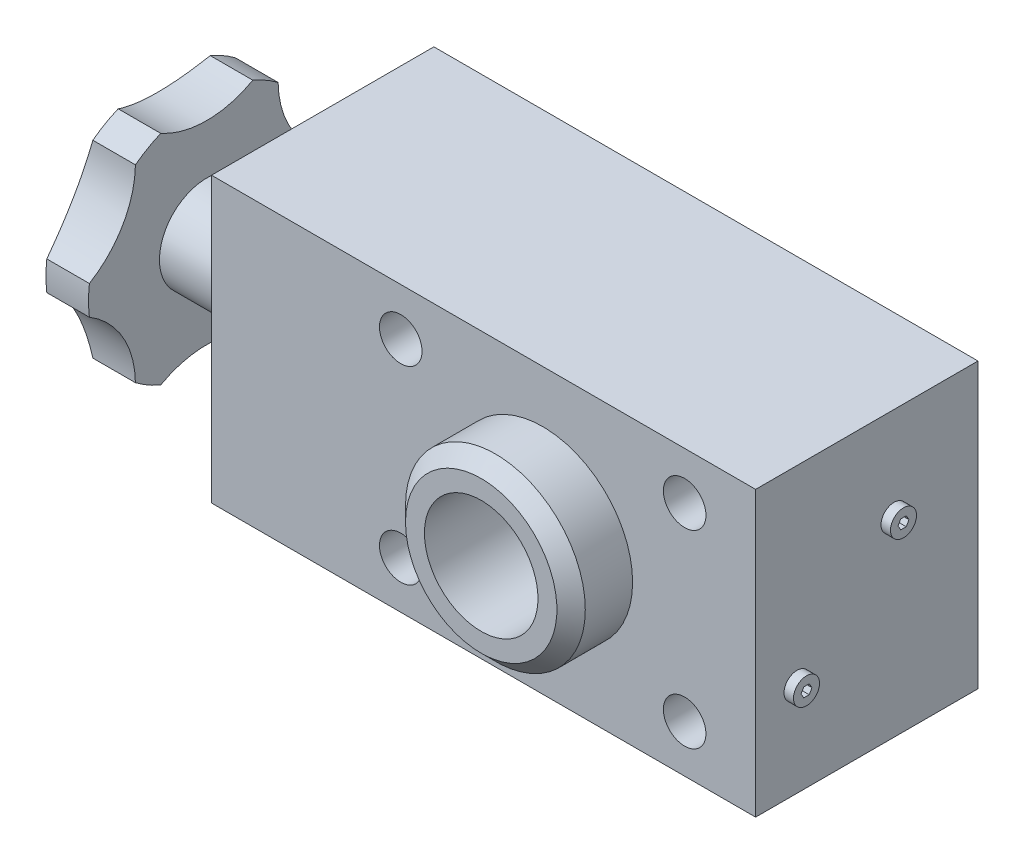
ISO-10303-21;
HEADER;
FILE_DESCRIPTION(('STEP AP214'),'2;1');
FILE_NAME('part.step','',(''),(''),'','','');
FILE_SCHEMA(('AUTOMOTIVE_DESIGN { 1 0 10303 214 1 1 1 1 }'));
ENDSEC;
DATA;
#1=APPLICATION_CONTEXT('core data for automotive mechanical design processes');
#2=APPLICATION_PROTOCOL_DEFINITION('international standard','automotive_design',2000,#1);
#3=PRODUCT_CONTEXT('',#1,'mechanical');
#4=PRODUCT('Part','Part','',(#3));
#5=PRODUCT_RELATED_PRODUCT_CATEGORY('part','',(#4));
#6=PRODUCT_DEFINITION_FORMATION('','',#4);
#7=PRODUCT_DEFINITION_CONTEXT('part definition',#1,'design');
#8=PRODUCT_DEFINITION('design','',#6,#7);
#9=PRODUCT_DEFINITION_SHAPE('','',#8);
#10=(LENGTH_UNIT() NAMED_UNIT(*) SI_UNIT(.MILLI.,.METRE.));
#11=(NAMED_UNIT(*) PLANE_ANGLE_UNIT() SI_UNIT($,.RADIAN.));
#12=(NAMED_UNIT(*) SI_UNIT($,.STERADIAN.) SOLID_ANGLE_UNIT());
#13=UNCERTAINTY_MEASURE_WITH_UNIT(LENGTH_MEASURE(1.E-05),#10,'distance_accuracy_value','');
#14=(GEOMETRIC_REPRESENTATION_CONTEXT(3) GLOBAL_UNCERTAINTY_ASSIGNED_CONTEXT((#13)) GLOBAL_UNIT_ASSIGNED_CONTEXT((#10,
#11,#12)) REPRESENTATION_CONTEXT('',''));
#15=CARTESIAN_POINT('',(0.,0.,0.));
#16=DIRECTION('',(0.,0.,1.));
#17=DIRECTION('',(1.,0.,0.));
#18=AXIS2_PLACEMENT_3D('',#15,#16,#17);
#19=CARTESIAN_POINT('',(-40.,50.,47.));
#20=DIRECTION('',(1.,0.,0.));
#21=DIRECTION('',(0.,0.,1.));
#22=AXIS2_PLACEMENT_3D('',#19,#20,#21);
#23=PLANE('',#22);
#24=DIRECTION('',(0.,-1.,0.));
#25=VECTOR('',#24,1.);
#26=CARTESIAN_POINT('',(-40.,50.,0.));
#27=LINE('',#26,#25);
#28=CARTESIAN_POINT('',(-40.,50.,0.));
#29=VERTEX_POINT('',#28);
#30=CARTESIAN_POINT('',(-40.,-10.,0.));
#31=VERTEX_POINT('',#30);
#32=EDGE_CURVE('E571',#29,#31,#27,.T.);
#33=ORIENTED_EDGE('',*,*,#32,.T.);
#34=DIRECTION('',(0.,0.,-1.));
#35=VECTOR('',#34,1.);
#36=CARTESIAN_POINT('',(-40.,-10.,47.));
#37=LINE('',#36,#35);
#38=CARTESIAN_POINT('',(-40.,-10.,47.));
#39=VERTEX_POINT('',#38);
#40=EDGE_CURVE('E554',#39,#31,#37,.T.);
#41=ORIENTED_EDGE('',*,*,#40,.F.);
#42=DIRECTION('',(0.,-1.,0.));
#43=VECTOR('',#42,1.);
#44=CARTESIAN_POINT('',(-40.,50.,47.));
#45=LINE('',#44,#43);
#46=CARTESIAN_POINT('',(-40.,50.,47.));
#47=VERTEX_POINT('',#46);
#48=EDGE_CURVE('E562',#47,#39,#45,.T.);
#49=ORIENTED_EDGE('',*,*,#48,.F.);
#50=DIRECTION('',(0.,0.,-1.));
#51=VECTOR('',#50,1.);
#52=CARTESIAN_POINT('',(-40.,50.,47.));
#53=LINE('',#52,#51);
#54=EDGE_CURVE('E551',#47,#29,#53,.T.);
#55=ORIENTED_EDGE('',*,*,#54,.T.);
#56=EDGE_LOOP('',(#33,#41,#49,#55));
#57=FACE_BOUND('',#56,.T.);
#58=CARTESIAN_POINT('',(-40.,20.,28.));
#59=DIRECTION('',(1.,0.,0.));
#60=DIRECTION('',(0.,0.,1.));
#61=AXIS2_PLACEMENT_3D('',#58,#59,#60);
#62=CIRCLE('',#61,10.);
#63=CARTESIAN_POINT('',(-40.,20.,38.));
#64=VERTEX_POINT('',#63);
#65=EDGE_CURVE('E9',#64,#64,#62,.F.);
#66=ORIENTED_EDGE('',*,*,#65,.F.);
#67=EDGE_LOOP('',(#66));
#68=FACE_BOUND('',#67,.T.);
#69=ADVANCED_FACE('F14',(#57,#68),#23,.F.);
#70=CARTESIAN_POINT('',(-40.,20.,28.));
#71=DIRECTION('',(-1.,0.,0.));
#72=DIRECTION('',(0.,0.,-1.));
#73=AXIS2_PLACEMENT_3D('',#70,#71,#72);
#74=CIRCLE('',#73,6.25);
#75=CARTESIAN_POINT('',(-40.,20.,21.75));
#76=VERTEX_POINT('',#75);
#77=EDGE_CURVE('E711',#76,#76,#74,.T.);
#78=ORIENTED_EDGE('',*,*,#77,.F.);
#79=EDGE_LOOP('',(#78));
#80=FACE_BOUND('',#79,.T.);
#81=CARTESIAN_POINT('',(-40.,20.,28.));
#82=DIRECTION('',(1.,0.,0.));
#83=DIRECTION('',(0.,0.,1.));
#84=AXIS2_PLACEMENT_3D('',#81,#82,#83);
#85=CIRCLE('',#84,7.1);
#86=CARTESIAN_POINT('',(-40.,20.,35.1));
#87=VERTEX_POINT('',#86);
#88=EDGE_CURVE('E22',#87,#87,#85,.T.);
#89=ORIENTED_EDGE('',*,*,#88,.F.);
#90=EDGE_LOOP('',(#89));
#91=FACE_BOUND('',#90,.T.);
#92=ADVANCED_FACE('F476',(#80,#91),#23,.F.);
#93=CARTESIAN_POINT('',(77.,30.253048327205,17.7469516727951));
#94=DIRECTION('',(1.,0.,0.));
#95=DIRECTION('',(0.,0.,-1.));
#96=AXIS2_PLACEMENT_3D('',#93,#94,#95);
#97=PLANE('',#96);
#98=DIRECTION('',(0.,-0.866025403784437,0.5));
#99=VECTOR('',#98,1.);
#100=CARTESIAN_POINT('',(77.,31.253048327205,18.3243019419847));
#101=LINE('',#100,#99);
#102=CARTESIAN_POINT('',(77.,31.253048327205,18.3243019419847));
#103=VERTEX_POINT('',#102);
#104=CARTESIAN_POINT('',(77.,30.253048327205,18.9016522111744));
#105=VERTEX_POINT('',#104);
#106=EDGE_CURVE('E29',#103,#105,#101,.T.);
#107=ORIENTED_EDGE('',*,*,#106,.F.);
#108=DIRECTION('',(0.,0.,1.));
#109=VECTOR('',#108,1.);
#110=CARTESIAN_POINT('',(77.,31.253048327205,17.1696014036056));
#111=LINE('',#110,#109);
#112=CARTESIAN_POINT('',(77.,31.253048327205,17.1696014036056));
#113=VERTEX_POINT('',#112);
#114=EDGE_CURVE('E232',#113,#103,#111,.T.);
#115=ORIENTED_EDGE('',*,*,#114,.F.);
#116=DIRECTION('',(0.,0.866025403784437,0.5));
#117=VECTOR('',#116,1.);
#118=CARTESIAN_POINT('',(77.,30.253048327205,16.5922511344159));
#119=LINE('',#118,#117);
#120=CARTESIAN_POINT('',(77.,30.253048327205,16.5922511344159));
#121=VERTEX_POINT('',#120);
#122=EDGE_CURVE('E235',#121,#113,#119,.T.);
#123=ORIENTED_EDGE('',*,*,#122,.F.);
#124=DIRECTION('',(0.,0.866025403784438,-0.5));
#125=VECTOR('',#124,1.);
#126=CARTESIAN_POINT('',(77.,29.253048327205,17.1696014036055));
#127=LINE('',#126,#125);
#128=CARTESIAN_POINT('',(77.,29.253048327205,17.1696014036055));
#129=VERTEX_POINT('',#128);
#130=EDGE_CURVE('E252',#129,#121,#127,.T.);
#131=ORIENTED_EDGE('',*,*,#130,.F.);
#132=DIRECTION('',(0.,0.,-1.));
#133=VECTOR('',#132,1.);
#134=CARTESIAN_POINT('',(77.,29.253048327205,18.3243019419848));
#135=LINE('',#134,#133);
#136=CARTESIAN_POINT('',(77.,29.253048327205,18.3243019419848));
#137=VERTEX_POINT('',#136);
#138=EDGE_CURVE('E249',#137,#129,#135,.T.);
#139=ORIENTED_EDGE('',*,*,#138,.F.);
#140=DIRECTION('',(0.,-0.866025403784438,-0.5));
#141=VECTOR('',#140,1.);
#142=CARTESIAN_POINT('',(77.,30.253048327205,18.9016522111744));
#143=LINE('',#142,#141);
#144=EDGE_CURVE('E246',#105,#137,#143,.T.);
#145=ORIENTED_EDGE('',*,*,#144,.F.);
#146=EDGE_LOOP('',(#107,#115,#123,#131,#139,#145));
#147=FACE_BOUND('',#146,.T.);
#148=CARTESIAN_POINT('',(77.,30.253048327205,17.7469516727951));
#149=DIRECTION('',(1.,0.,0.));
#150=DIRECTION('',(0.,0.,-1.));
#151=AXIS2_PLACEMENT_3D('',#148,#149,#150);
#152=CIRCLE('',#151,2.75);
#153=CARTESIAN_POINT('',(77.,30.253048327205,14.9969516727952));
#154=VERTEX_POINT('',#153);
#155=EDGE_CURVE('E523',#154,#154,#152,.T.);
#156=ORIENTED_EDGE('',*,*,#155,.T.);
#157=EDGE_LOOP('',(#156));
#158=FACE_BOUND('',#157,.T.);
#159=ADVANCED_FACE('F482',(#147,#158),#97,.T.);
#160=CARTESIAN_POINT('',(77.,30.253048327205,17.7469516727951));
#161=DIRECTION('',(-1.,0.,0.));
#162=DIRECTION('',(0.,0.,1.));
#163=AXIS2_PLACEMENT_3D('',#160,#161,#162);
#164=CYLINDRICAL_SURFACE('',#163,2.75);
#165=ORIENTED_EDGE('',*,*,#155,.F.);
#166=EDGE_LOOP('',(#165));
#167=FACE_BOUND('',#166,.T.);
#168=CARTESIAN_POINT('',(75.,30.253048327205,17.7469516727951));
#169=DIRECTION('',(1.,0.,0.));
#170=DIRECTION('',(0.,0.,-1.));
#171=AXIS2_PLACEMENT_3D('',#168,#169,#170);
#172=CIRCLE('',#171,2.75);
#173=CARTESIAN_POINT('',(75.,30.253048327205,14.9969516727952));
#174=VERTEX_POINT('',#173);
#175=EDGE_CURVE('E524',#174,#174,#172,.T.);
#176=ORIENTED_EDGE('',*,*,#175,.T.);
#177=EDGE_LOOP('',(#176));
#178=FACE_BOUND('',#177,.T.);
#179=ADVANCED_FACE('F16',(#167,#178),#164,.T.);
#180=CARTESIAN_POINT('',(71.,20.,28.));
#181=DIRECTION('',(-1.,0.,0.));
#182=DIRECTION('',(0.,0.145988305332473,-0.989286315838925));
#183=AXIS2_PLACEMENT_3D('',#180,#181,#182);
#184=PLANE('',#183);
#185=CARTESIAN_POINT('',(71.,20.,28.));
#186=DIRECTION('',(-1.,0.,0.));
#187=DIRECTION('',(0.,0.,-1.));
#188=AXIS2_PLACEMENT_3D('',#185,#186,#187);
#189=CIRCLE('',#188,10.);
#190=CARTESIAN_POINT('',(71.,20.,18.));
#191=VERTEX_POINT('',#190);
#192=EDGE_CURVE('E536',#191,#191,#189,.T.);
#193=ORIENTED_EDGE('',*,*,#192,.T.);
#194=EDGE_LOOP('',(#193));
#195=FACE_BOUND('',#194,.T.);
#196=ADVANCED_FACE('F500',(#195),#184,.T.);
#197=CARTESIAN_POINT('',(30.,20.,25.));
#198=DIRECTION('',(0.,0.,1.));
#199=DIRECTION('',(-1.,0.,0.));
#200=AXIS2_PLACEMENT_3D('',#197,#198,#199);
#201=PLANE('',#200);
#202=DIRECTION('',(1.,0.,0.));
#203=VECTOR('',#202,1.);
#204=CARTESIAN_POINT('',(-23.5,29.5393920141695,25.));
#205=LINE('',#204,#203);
#206=CARTESIAN_POINT('',(37.2801098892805,29.5393920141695,25.));
#207=VERTEX_POINT('',#206);
#208=CARTESIAN_POINT('',(22.7198901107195,29.5393920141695,25.));
#209=VERTEX_POINT('',#208);
#210=EDGE_CURVE('E721',#207,#209,#205,.F.);
#211=ORIENTED_EDGE('',*,*,#210,.F.);
#212=CARTESIAN_POINT('',(30.,20.,25.));
#213=DIRECTION('',(0.,0.,1.));
#214=DIRECTION('',(-1.,0.,0.));
#215=AXIS2_PLACEMENT_3D('',#212,#213,#214);
#216=CIRCLE('',#215,12.);
#217=EDGE_CURVE('E581',#207,#209,#216,.T.);
#218=ORIENTED_EDGE('',*,*,#217,.T.);
#219=EDGE_LOOP('',(#211,#218));
#220=FACE_BOUND('',#219,.T.);
#221=ADVANCED_FACE('F503',(#220),#201,.T.);
#222=CARTESIAN_POINT('',(-23.5,20.,28.));
#223=DIRECTION('',(1.,0.,0.));
#224=DIRECTION('',(0.,0.,1.));
#225=AXIS2_PLACEMENT_3D('',#222,#223,#224);
#226=CYLINDRICAL_SURFACE('',#225,10.);
#227=DIRECTION('',(1.,0.,0.));
#228=VECTOR('',#227,1.);
#229=CARTESIAN_POINT('',(-23.5,10.4606079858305,25.));
#230=LINE('',#229,#228);
#231=CARTESIAN_POINT('',(22.7198901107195,10.4606079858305,25.));
#232=VERTEX_POINT('',#231);
#233=CARTESIAN_POINT('',(37.2801098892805,10.4606079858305,25.));
#234=VERTEX_POINT('',#233);
#235=EDGE_CURVE('E585',#232,#234,#230,.T.);
#236=ORIENTED_EDGE('',*,*,#235,.T.);
#237=CARTESIAN_POINT('',(37.2801098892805,29.5393920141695,25.));
#238=CARTESIAN_POINT('',(37.2145681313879,29.5894175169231,25.1590718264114));
#239=CARTESIAN_POINT('',(37.1522761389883,29.6358795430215,25.3207162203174));
#240=CARTESIAN_POINT('',(37.0358191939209,29.7212367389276,25.6491695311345));
#241=CARTESIAN_POINT('',(36.9816682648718,29.7601188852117,25.8159867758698));
#242=CARTESIAN_POINT('',(36.8831923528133,29.8298183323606,26.154824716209));
#243=CARTESIAN_POINT('',(36.8389006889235,29.8606083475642,26.3268608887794));
#244=CARTESIAN_POINT('',(36.762188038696,29.9133741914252,26.6748705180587));
#245=CARTESIAN_POINT('',(36.7297636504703,29.9353525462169,26.8508428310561));
#246=CARTESIAN_POINT('',(36.6780551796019,29.970184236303,27.2076091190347));
#247=CARTESIAN_POINT('',(36.6589177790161,29.9829357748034,27.3884347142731));
#248=CARTESIAN_POINT('',(36.6354313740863,29.9985626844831,27.7514959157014));
#249=CARTESIAN_POINT('',(36.6310831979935,30.0014375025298,27.9337316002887));
#250=CARTESIAN_POINT('',(36.6374241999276,29.9972302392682,28.2971126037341));
#251=CARTESIAN_POINT('',(36.6480549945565,29.9901868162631,28.4782594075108));
#252=CARTESIAN_POINT('',(36.6836299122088,29.9664205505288,28.8384874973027));
#253=CARTESIAN_POINT('',(36.7085754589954,29.9496967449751,29.0175685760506));
#254=CARTESIAN_POINT('',(36.7749217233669,29.9046559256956,29.3918019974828));
#255=CARTESIAN_POINT('',(36.8178306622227,29.875266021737,29.5865553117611));
#256=CARTESIAN_POINT('',(36.9173046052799,29.8058431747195,29.9706825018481));
#257=CARTESIAN_POINT('',(36.9738797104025,29.765802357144,30.1600522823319));
#258=CARTESIAN_POINT('',(37.098411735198,29.675663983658,30.5334951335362));
#259=CARTESIAN_POINT('',(37.1664185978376,29.6255220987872,30.7175406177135));
#260=CARTESIAN_POINT('',(37.3112269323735,29.5159976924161,31.0792015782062));
#261=CARTESIAN_POINT('',(37.3880264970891,29.4566171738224,31.256818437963));
#262=CARTESIAN_POINT('',(37.5957048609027,29.2914864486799,31.7088610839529));
#263=CARTESIAN_POINT('',(37.7317314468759,29.1790647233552,31.9784984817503));
#264=CARTESIAN_POINT('',(38.0140536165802,28.9336449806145,32.5026421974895));
#265=CARTESIAN_POINT('',(38.1603550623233,28.8006351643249,32.7571397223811));
#266=CARTESIAN_POINT('',(38.4582332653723,28.514748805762,33.2517302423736));
#267=CARTESIAN_POINT('',(38.6098135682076,28.3618587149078,33.4918132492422));
#268=CARTESIAN_POINT('',(38.914121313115,28.0366688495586,33.9575663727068));
#269=CARTESIAN_POINT('',(39.066848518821,27.8643729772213,34.1832393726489));
#270=CARTESIAN_POINT('',(39.3771672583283,27.4920068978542,34.6301040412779));
#271=CARTESIAN_POINT('',(39.5346567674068,27.2910202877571,34.8506048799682));
#272=CARTESIAN_POINT('',(39.8438608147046,26.867830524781,35.2747957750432));
#273=CARTESIAN_POINT('',(39.995574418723,26.6456239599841,35.4784831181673));
#274=CARTESIAN_POINT('',(40.2896203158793,26.1805553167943,35.8671718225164));
#275=CARTESIAN_POINT('',(40.4319704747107,25.937734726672,36.0522091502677));
#276=CARTESIAN_POINT('',(40.7042890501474,25.4314575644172,36.4020142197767));
#277=CARTESIAN_POINT('',(40.8342624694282,25.1680094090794,36.5667901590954));
#278=CARTESIAN_POINT('',(41.0452016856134,24.6958476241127,36.8318191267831));
#279=CARTESIAN_POINT('',(41.1298727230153,24.4917733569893,36.9374213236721));
#280=CARTESIAN_POINT('',(41.2895758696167,24.0737578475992,37.1355329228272));
#281=CARTESIAN_POINT('',(41.3646103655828,23.8598190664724,37.2280455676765));
#282=CARTESIAN_POINT('',(41.503726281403,23.422981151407,37.3988387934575));
#283=CARTESIAN_POINT('',(41.5678124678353,23.2000859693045,37.4771255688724));
#284=CARTESIAN_POINT('',(41.6838412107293,22.7463920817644,37.6184079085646));
#285=CARTESIAN_POINT('',(41.7357835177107,22.5155932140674,37.6814031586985));
#286=CARTESIAN_POINT('',(41.8267393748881,22.0459325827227,37.7914621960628));
#287=CARTESIAN_POINT('',(41.8656594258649,21.8070255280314,37.8384108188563));
#288=CARTESIAN_POINT('',(41.9291567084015,21.3245435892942,37.9148996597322));
#289=CARTESIAN_POINT('',(41.9537339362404,21.0809687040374,37.9444398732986));
#290=CARTESIAN_POINT('',(41.9879316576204,20.5913496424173,37.9855212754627));
#291=CARTESIAN_POINT('',(41.9975578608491,20.3453064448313,37.9970693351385));
#292=CARTESIAN_POINT('',(42.0016234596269,19.8529256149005,38.0019482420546));
#293=CARTESIAN_POINT('',(41.9960641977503,19.6065880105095,37.9952806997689));
#294=CARTESIAN_POINT('',(41.9713255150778,19.1424407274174,37.9655752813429));
#295=CARTESIAN_POINT('',(41.9536837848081,18.9244264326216,37.9443854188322));
#296=CARTESIAN_POINT('',(41.9067953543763,18.4914808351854,37.8879736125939));
#297=CARTESIAN_POINT('',(41.8775483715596,18.2765496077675,37.8527513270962));
#298=CARTESIAN_POINT('',(41.8080049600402,17.8511689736,37.7688040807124));
#299=CARTESIAN_POINT('',(41.7677082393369,17.6407196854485,37.7200787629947));
#300=CARTESIAN_POINT('',(41.6767849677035,17.2254963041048,37.6098012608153));
#301=CARTESIAN_POINT('',(41.6261578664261,17.0207225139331,37.5482483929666));
#302=CARTESIAN_POINT('',(41.5138260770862,16.612081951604,37.4111518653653));
#303=CARTESIAN_POINT('',(41.4518459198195,16.4084087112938,37.3352583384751));
#304=CARTESIAN_POINT('',(41.3188083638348,16.0088936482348,37.1715700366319));
#305=CARTESIAN_POINT('',(41.2477476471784,15.8130547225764,37.0837709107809));
#306=CARTESIAN_POINT('',(41.097597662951,15.4299170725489,36.8971761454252));
#307=CARTESIAN_POINT('',(41.0185089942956,15.2426177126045,36.7983813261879));
#308=CARTESIAN_POINT('',(40.8533243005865,14.8769517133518,36.5906120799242));
#309=CARTESIAN_POINT('',(40.7672268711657,14.6985868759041,36.48163561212));
#310=CARTESIAN_POINT('',(40.5480782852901,14.2711909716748,36.2019882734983));
#311=CARTESIAN_POINT('',(40.4116353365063,14.0273627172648,36.025983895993));
#312=CARTESIAN_POINT('',(40.1290924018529,13.5598010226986,35.6559004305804));
#313=CARTESIAN_POINT('',(39.9829886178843,13.3360755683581,35.4618142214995));
#314=CARTESIAN_POINT('',(39.6837444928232,12.9082125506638,35.0564636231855));
#315=CARTESIAN_POINT('',(39.5305828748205,12.7041408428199,34.8451455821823));
#316=CARTESIAN_POINT('',(39.2208791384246,12.3164508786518,34.4069232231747));
#317=CARTESIAN_POINT('',(39.0643375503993,12.132829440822,34.1800213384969));
#318=CARTESIAN_POINT('',(38.7485066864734,11.7829361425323,33.7068382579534));
#319=CARTESIAN_POINT('',(38.5892184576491,11.6170342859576,33.4602825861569));
#320=CARTESIAN_POINT('',(38.2749287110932,11.3066505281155,32.9512235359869));
#321=CARTESIAN_POINT('',(38.1199291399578,11.1621782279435,32.6887130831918));
#322=CARTESIAN_POINT('',(37.8202223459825,10.8959274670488,32.1480527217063));
#323=CARTESIAN_POINT('',(37.6754829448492,10.7740759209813,31.8699570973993));
#324=CARTESIAN_POINT('',(37.4030793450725,10.5541014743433,31.2968441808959));
#325=CARTESIAN_POINT('',(37.2753952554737,10.4559508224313,31.001847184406));
#326=CARTESIAN_POINT('',(37.0426075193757,10.2828231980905,30.383806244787));
#327=CARTESIAN_POINT('',(36.9384016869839,10.2087308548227,30.0601543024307));
#328=CARTESIAN_POINT('',(36.8130970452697,10.1215237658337,29.563308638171));
#329=CARTESIAN_POINT('',(36.7765248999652,10.0964611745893,29.3960335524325));
#330=CARTESIAN_POINT('',(36.7151018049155,10.0547099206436,29.0583484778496));
#331=CARTESIAN_POINT('',(36.6902450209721,10.0380170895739,28.8879400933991));
#332=CARTESIAN_POINT('',(36.6532718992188,10.0132847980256,28.5436484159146));
#333=CARTESIAN_POINT('',(36.6412643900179,10.0053192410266,28.3697479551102));
#334=CARTESIAN_POINT('',(36.6309985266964,9.99850519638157,28.0213567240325));
#335=CARTESIAN_POINT('',(36.6327402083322,9.99965673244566,27.8468659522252));
#336=CARTESIAN_POINT('',(36.6499190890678,10.0110720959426,27.498123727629));
#337=CARTESIAN_POINT('',(36.6654141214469,10.0213744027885,27.3238764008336));
#338=CARTESIAN_POINT('',(36.7093435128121,10.0508595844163,26.9778474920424));
#339=CARTESIAN_POINT('',(36.7377772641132,10.0700420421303,26.8060657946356));
#340=CARTESIAN_POINT('',(36.8295230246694,10.1327567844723,26.3506492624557));
#341=CARTESIAN_POINT('',(36.9034122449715,10.183980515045,26.0701336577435));
#342=CARTESIAN_POINT('',(37.0326200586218,10.2765742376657,25.6602251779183));
#343=CARTESIAN_POINT('',(37.078576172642,10.3099339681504,25.5258113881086));
#344=CARTESIAN_POINT('',(37.1756729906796,10.381612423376,25.2603973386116));
#345=CARTESIAN_POINT('',(37.2268076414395,10.419925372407,25.1293933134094));
#346=CARTESIAN_POINT('',(37.2801098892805,10.4606079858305,25.));
#347=B_SPLINE_CURVE_WITH_KNOTS('',3,(#237,#238,#239,#240,#241,#242,#243,#244,#245,#246,#247,
#248,#249,#250,#251,#252,#253,#254,#255,#256,#257,#258,#259,#260,#261,#262,#263,#264,#265,#266,
#267,#268,#269,#270,#271,#272,#273,#274,#275,#276,#277,#278,#279,#280,#281,#282,#283,#284,#285,
#286,#287,#288,#289,#290,#291,#292,#293,#294,#295,#296,#297,#298,#299,#300,#301,#302,#303,#304,
#305,#306,#307,#308,#309,#310,#311,#312,#313,#314,#315,#316,#317,#318,#319,#320,#321,#322,#323,
#324,#325,#326,#327,#328,#329,#330,#331,#332,#333,#334,#335,#336,#337,#338,#339,#340,#341,#342,
#343,#344,#345,#346),.UNSPECIFIED.,.F.,.F.,(4,2,2,2,2,2,2,2,2,2,2,2,2,2,2,2,2,2,2,2,2,2,2,2,2,2,
2,2,2,2,2,2,2,2,2,2,2,2,2,2,2,2,2,2,2,2,2,2,2,2,2,2,2,2,4),(0.,0.537579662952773,
1.07607499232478,1.61636341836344,2.15649684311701,2.70250213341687,3.24853800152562,
3.79245146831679,4.33641904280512,4.94022273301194,5.54447407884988,6.15143735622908,
6.75826922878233,7.72354699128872,8.68938000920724,9.65587473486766,10.6221754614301,
11.6331995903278,12.6443865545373,13.6535845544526,14.6623728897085,15.3963589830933,
16.1301629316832,16.8636465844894,17.5971453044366,18.3358028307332,19.0744605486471,
19.8128361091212,20.5511463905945,21.2096260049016,21.8681216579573,22.5266347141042,
23.1851828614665,23.8625704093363,24.5402061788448,25.2177914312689,25.8955127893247,
26.8847484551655,27.8743753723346,28.8672106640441,29.8598912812,30.8703662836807,
31.8812926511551,32.8888937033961,33.8953091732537,34.9353773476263,35.4540051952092,
35.9723744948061,36.4951002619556,37.0178273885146,37.542763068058,38.0676740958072,
38.9484330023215,39.3860301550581,39.8231215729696),.UNSPECIFIED.);
#348=EDGE_CURVE('E596',#207,#234,#347,.T.);
#349=ORIENTED_EDGE('',*,*,#348,.F.);
#350=ORIENTED_EDGE('',*,*,#210,.T.);
#351=CARTESIAN_POINT('',(22.7198901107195,10.4606079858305,25.));
#352=CARTESIAN_POINT('',(22.7854318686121,10.4105824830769,25.1590718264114));
#353=CARTESIAN_POINT('',(22.8477238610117,10.3641204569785,25.3207162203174));
#354=CARTESIAN_POINT('',(22.9641808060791,10.2787632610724,25.6491695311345));
#355=CARTESIAN_POINT('',(23.0183317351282,10.2398811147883,25.8159867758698));
#356=CARTESIAN_POINT('',(23.1168076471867,10.1701816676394,26.154824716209));
#357=CARTESIAN_POINT('',(23.1610993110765,10.1393916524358,26.3268608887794));
#358=CARTESIAN_POINT('',(23.2378119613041,10.0866258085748,26.6748705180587));
#359=CARTESIAN_POINT('',(23.2702363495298,10.0646474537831,26.8508428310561));
#360=CARTESIAN_POINT('',(23.3219448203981,10.029815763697,27.2076091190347));
#361=CARTESIAN_POINT('',(23.3410822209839,10.0170642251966,27.3884347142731));
#362=CARTESIAN_POINT('',(23.3645686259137,10.0014373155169,27.7514959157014));
#363=CARTESIAN_POINT('',(23.3689168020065,9.99856249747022,27.9337316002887));
#364=CARTESIAN_POINT('',(23.3625758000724,10.0027697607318,28.2971126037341));
#365=CARTESIAN_POINT('',(23.3519450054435,10.0098131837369,28.4782594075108));
#366=CARTESIAN_POINT('',(23.3163700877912,10.0335794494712,28.8384874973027));
#367=CARTESIAN_POINT('',(23.2914245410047,10.0503032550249,29.0175685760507));
#368=CARTESIAN_POINT('',(23.2250782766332,10.0953440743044,29.3918019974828));
#369=CARTESIAN_POINT('',(23.1821693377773,10.124733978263,29.5865553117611));
#370=CARTESIAN_POINT('',(23.0826953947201,10.1941568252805,29.9706825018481));
#371=CARTESIAN_POINT('',(23.0261202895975,10.234197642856,30.1600522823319));
#372=CARTESIAN_POINT('',(22.901588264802,10.324336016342,30.5334951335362));
#373=CARTESIAN_POINT('',(22.8335814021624,10.3744779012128,30.7175406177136));
#374=CARTESIAN_POINT('',(22.6887730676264,10.4840023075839,31.0792015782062));
#375=CARTESIAN_POINT('',(22.6119735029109,10.5433828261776,31.256818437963));
#376=CARTESIAN_POINT('',(22.4042951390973,10.7085135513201,31.7088610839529));
#377=CARTESIAN_POINT('',(22.268268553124,10.8209352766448,31.9784984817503));
#378=CARTESIAN_POINT('',(21.9859463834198,11.0663550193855,32.5026421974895));
#379=CARTESIAN_POINT('',(21.8396449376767,11.1993648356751,32.7571397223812));
#380=CARTESIAN_POINT('',(21.5417667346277,11.485251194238,33.2517302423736));
#381=CARTESIAN_POINT('',(21.3901864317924,11.6381412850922,33.4918132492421));
#382=CARTESIAN_POINT('',(21.0858786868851,11.9633311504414,33.9575663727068));
#383=CARTESIAN_POINT('',(20.9331514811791,12.1356270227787,34.1832393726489));
#384=CARTESIAN_POINT('',(20.6228327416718,12.5079931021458,34.6301040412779));
#385=CARTESIAN_POINT('',(20.4653432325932,12.7089797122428,34.8506048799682));
#386=CARTESIAN_POINT('',(20.1561391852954,13.132169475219,35.2747957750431));
#387=CARTESIAN_POINT('',(20.004425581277,13.3543760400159,35.4784831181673));
#388=CARTESIAN_POINT('',(19.7103796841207,13.8194446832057,35.8671718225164));
#389=CARTESIAN_POINT('',(19.5680295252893,14.0622652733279,36.0522091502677));
#390=CARTESIAN_POINT('',(19.2957109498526,14.5685424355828,36.4020142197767));
#391=CARTESIAN_POINT('',(19.1657375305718,14.8319905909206,36.5667901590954));
#392=CARTESIAN_POINT('',(18.9547983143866,15.3041523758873,36.8318191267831));
#393=CARTESIAN_POINT('',(18.8701272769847,15.5082266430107,36.9374213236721));
#394=CARTESIAN_POINT('',(18.7104241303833,15.9262421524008,37.1355329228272));
#395=CARTESIAN_POINT('',(18.6353896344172,16.1401809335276,37.2280455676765));
#396=CARTESIAN_POINT('',(18.496273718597,16.577018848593,37.3988387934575));
#397=CARTESIAN_POINT('',(18.4321875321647,16.7999140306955,37.4771255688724));
#398=CARTESIAN_POINT('',(18.3161587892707,17.2536079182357,37.6184079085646));
#399=CARTESIAN_POINT('',(18.2642164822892,17.4844067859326,37.6814031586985));
#400=CARTESIAN_POINT('',(18.1732606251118,17.9540674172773,37.7914621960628));
#401=CARTESIAN_POINT('',(18.134340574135,18.1929744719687,37.8384108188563));
#402=CARTESIAN_POINT('',(18.0708432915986,18.6754564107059,37.9148996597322));
#403=CARTESIAN_POINT('',(18.0462660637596,18.9190312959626,37.9444398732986));
#404=CARTESIAN_POINT('',(18.0120683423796,19.4086503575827,37.9855212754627));
#405=CARTESIAN_POINT('',(18.0024421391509,19.6546935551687,37.9970693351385));
#406=CARTESIAN_POINT('',(17.9983765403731,20.1470743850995,38.0019482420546));
#407=CARTESIAN_POINT('',(18.0039358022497,20.3934119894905,37.9952806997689));
#408=CARTESIAN_POINT('',(18.0286744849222,20.8575592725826,37.9655752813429));
#409=CARTESIAN_POINT('',(18.0463162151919,21.0755735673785,37.9443854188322));
#410=CARTESIAN_POINT('',(18.0932046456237,21.5085191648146,37.8879736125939));
#411=CARTESIAN_POINT('',(18.1224516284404,21.7234503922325,37.8527513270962));
#412=CARTESIAN_POINT('',(18.1919950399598,22.1488310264,37.7688040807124));
#413=CARTESIAN_POINT('',(18.2322917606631,22.3592803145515,37.7200787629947));
#414=CARTESIAN_POINT('',(18.3232150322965,22.7745036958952,37.6098012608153));
#415=CARTESIAN_POINT('',(18.3738421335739,22.9792774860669,37.5482483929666));
#416=CARTESIAN_POINT('',(18.4861739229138,23.387918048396,37.4111518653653));
#417=CARTESIAN_POINT('',(18.5481540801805,23.5915912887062,37.3352583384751));
#418=CARTESIAN_POINT('',(18.6811916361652,23.9911063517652,37.1715700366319));
#419=CARTESIAN_POINT('',(18.7522523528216,24.1869452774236,37.0837709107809));
#420=CARTESIAN_POINT('',(18.902402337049,24.5700829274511,36.8971761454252));
#421=CARTESIAN_POINT('',(18.9814910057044,24.7573822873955,36.7983813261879));
#422=CARTESIAN_POINT('',(19.1466756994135,25.1230482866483,36.5906120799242));
#423=CARTESIAN_POINT('',(19.2327731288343,25.3014131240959,36.48163561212));
#424=CARTESIAN_POINT('',(19.4519217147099,25.7288090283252,36.2019882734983));
#425=CARTESIAN_POINT('',(19.5883646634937,25.9726372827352,36.025983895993));
#426=CARTESIAN_POINT('',(19.8709075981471,26.4401989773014,35.6559004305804));
#427=CARTESIAN_POINT('',(20.0170113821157,26.6639244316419,35.4618142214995));
#428=CARTESIAN_POINT('',(20.3162555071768,27.0917874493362,35.0564636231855));
#429=CARTESIAN_POINT('',(20.4694171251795,27.2958591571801,34.8451455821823));
#430=CARTESIAN_POINT('',(20.7791208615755,27.6835491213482,34.4069232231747));
#431=CARTESIAN_POINT('',(20.9356624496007,27.867170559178,34.1800213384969));
#432=CARTESIAN_POINT('',(21.2514933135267,28.2170638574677,33.7068382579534));
#433=CARTESIAN_POINT('',(21.4107815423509,28.3829657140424,33.4602825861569));
#434=CARTESIAN_POINT('',(21.7250712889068,28.6933494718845,32.9512235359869));
#435=CARTESIAN_POINT('',(21.8800708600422,28.8378217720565,32.6887130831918));
#436=CARTESIAN_POINT('',(22.1797776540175,29.1040725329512,32.1480527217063));
#437=CARTESIAN_POINT('',(22.3245170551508,29.2259240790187,31.8699570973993));
#438=CARTESIAN_POINT('',(22.5969206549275,29.4458985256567,31.2968441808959));
#439=CARTESIAN_POINT('',(22.7246047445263,29.5440491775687,31.001847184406));
#440=CARTESIAN_POINT('',(22.9573924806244,29.7171768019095,30.383806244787));
#441=CARTESIAN_POINT('',(23.0615983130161,29.7912691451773,30.0601543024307));
#442=CARTESIAN_POINT('',(23.1869029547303,29.8784762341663,29.563308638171));
#443=CARTESIAN_POINT('',(23.2234751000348,29.9035388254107,29.3960335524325));
#444=CARTESIAN_POINT('',(23.2848981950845,29.9452900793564,29.0583484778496));
#445=CARTESIAN_POINT('',(23.3097549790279,29.9619829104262,28.8879400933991));
#446=CARTESIAN_POINT('',(23.3467281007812,29.9867152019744,28.5436484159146));
#447=CARTESIAN_POINT('',(23.3587356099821,29.9946807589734,28.3697479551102));
#448=CARTESIAN_POINT('',(23.3690014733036,30.0014948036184,28.0213567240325));
#449=CARTESIAN_POINT('',(23.3672597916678,30.0003432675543,27.8468659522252));
#450=CARTESIAN_POINT('',(23.3500809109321,29.9889279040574,27.498123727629));
#451=CARTESIAN_POINT('',(23.3345858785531,29.9786255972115,27.3238764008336));
#452=CARTESIAN_POINT('',(23.2906564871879,29.9491404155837,26.9778474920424));
#453=CARTESIAN_POINT('',(23.2622227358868,29.9299579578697,26.8060657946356));
#454=CARTESIAN_POINT('',(23.1704769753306,29.8672432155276,26.3506492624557));
#455=CARTESIAN_POINT('',(23.0965877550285,29.816019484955,26.0701336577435));
#456=CARTESIAN_POINT('',(22.9673799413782,29.7234257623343,25.6602251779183));
#457=CARTESIAN_POINT('',(22.921423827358,29.6900660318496,25.5258113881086));
#458=CARTESIAN_POINT('',(22.8243270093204,29.618387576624,25.2603973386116));
#459=CARTESIAN_POINT('',(22.7731923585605,29.580074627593,25.1293933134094));
#460=CARTESIAN_POINT('',(22.7198901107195,29.5393920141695,25.));
#461=B_SPLINE_CURVE_WITH_KNOTS('',3,(#351,#352,#353,#354,#355,#356,#357,#358,#359,#360,#361,
#362,#363,#364,#365,#366,#367,#368,#369,#370,#371,#372,#373,#374,#375,#376,#377,#378,#379,#380,
#381,#382,#383,#384,#385,#386,#387,#388,#389,#390,#391,#392,#393,#394,#395,#396,#397,#398,#399,
#400,#401,#402,#403,#404,#405,#406,#407,#408,#409,#410,#411,#412,#413,#414,#415,#416,#417,#418,
#419,#420,#421,#422,#423,#424,#425,#426,#427,#428,#429,#430,#431,#432,#433,#434,#435,#436,#437,
#438,#439,#440,#441,#442,#443,#444,#445,#446,#447,#448,#449,#450,#451,#452,#453,#454,#455,#456,
#457,#458,#459,#460),.UNSPECIFIED.,.F.,.F.,(4,2,2,2,2,2,2,2,2,2,2,2,2,2,2,2,2,2,2,2,2,2,2,2,2,2,
2,2,2,2,2,2,2,2,2,2,2,2,2,2,2,2,2,2,2,2,2,2,2,2,2,2,2,2,4),(0.,0.537579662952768,
1.07607499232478,1.61636341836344,2.15649684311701,2.70250213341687,3.24853800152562,
3.79245146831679,4.33641904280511,4.94022273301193,5.54447407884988,6.15143735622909,
6.75826922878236,7.72354699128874,8.68938000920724,9.65587473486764,10.6221754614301,
11.6331995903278,12.6443865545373,13.6535845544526,14.6623728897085,15.3963589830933,
16.1301629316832,16.8636465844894,17.5971453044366,18.3358028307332,19.074460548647,
19.8128361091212,20.5511463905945,21.2096260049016,21.8681216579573,22.5266347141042,
23.1851828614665,23.8625704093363,24.5402061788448,25.2177914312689,25.8955127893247,
26.8847484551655,27.8743753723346,28.8672106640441,29.8598912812,30.8703662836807,
31.8812926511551,32.8888937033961,33.8953091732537,34.9353773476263,35.4540051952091,
35.9723744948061,36.4951002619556,37.0178273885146,37.542763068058,38.0676740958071,
38.9484330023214,39.386030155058,39.8231215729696),.UNSPECIFIED.);
#462=EDGE_CURVE('E587',#232,#209,#461,.T.);
#463=ORIENTED_EDGE('',*,*,#462,.F.);
#464=EDGE_LOOP('',(#236,#349,#350,#463));
#465=FACE_BOUND('',#464,.T.);
#466=CARTESIAN_POINT('',(-23.5,20.,28.));
#467=DIRECTION('',(1.,0.,0.));
#468=DIRECTION('',(0.,0.,1.));
#469=AXIS2_PLACEMENT_3D('',#466,#467,#468);
#470=CIRCLE('',#469,10.);
#471=CARTESIAN_POINT('',(-23.5,20.,38.));
#472=VERTEX_POINT('',#471);
#473=EDGE_CURVE('E719',#472,#472,#470,.T.);
#474=ORIENTED_EDGE('',*,*,#473,.F.);
#475=EDGE_LOOP('',(#474));
#476=FACE_BOUND('',#475,.T.);
#477=ORIENTED_EDGE('',*,*,#192,.F.);
#478=EDGE_LOOP('',(#477));
#479=FACE_BOUND('',#478,.T.);
#480=ADVANCED_FACE('F606',(#465,#476,#479),#226,.F.);
#481=ORIENTED_EDGE('',*,*,#235,.F.);
#482=EDGE_CURVE('E578',#232,#234,#216,.T.);
#483=ORIENTED_EDGE('',*,*,#482,.T.);
#484=EDGE_LOOP('',(#481,#483));
#485=FACE_BOUND('',#484,.T.);
#486=ADVANCED_FACE('F505',(#485),#201,.T.);
#487=CARTESIAN_POINT('',(-23.5,20.,28.));
#488=DIRECTION('',(1.,0.,0.));
#489=DIRECTION('',(0.,0.,1.));
#490=AXIS2_PLACEMENT_3D('',#487,#488,#489);
#491=PLANE('',#490);
#492=CARTESIAN_POINT('',(-23.5,20.,28.));
#493=DIRECTION('',(1.,0.,0.));
#494=DIRECTION('',(0.,0.,1.));
#495=AXIS2_PLACEMENT_3D('',#492,#493,#494);
#496=CIRCLE('',#495,8.25);
#497=CARTESIAN_POINT('',(-23.5,20.,36.25));
#498=VERTEX_POINT('',#497);
#499=EDGE_CURVE('E1251',#498,#498,#496,.T.);
#500=ORIENTED_EDGE('',*,*,#499,.F.);
#501=EDGE_LOOP('',(#500));
#502=FACE_BOUND('',#501,.T.);
#503=ORIENTED_EDGE('',*,*,#473,.T.);
#504=EDGE_LOOP('',(#503));
#505=FACE_BOUND('',#504,.T.);
#506=ADVANCED_FACE('F613',(#502,#505),#491,.T.);
#507=CARTESIAN_POINT('',(30.,20.,25.));
#508=DIRECTION('',(0.,0.,1.));
#509=DIRECTION('',(-1.,0.,0.));
#510=AXIS2_PLACEMENT_3D('',#507,#508,#509);
#511=CYLINDRICAL_SURFACE('',#510,12.);
#512=ORIENTED_EDGE('',*,*,#482,.F.);
#513=ORIENTED_EDGE('',*,*,#462,.T.);
#514=ORIENTED_EDGE('',*,*,#217,.F.);
#515=ORIENTED_EDGE('',*,*,#348,.T.);
#516=EDGE_LOOP('',(#512,#513,#514,#515));
#517=FACE_BOUND('',#516,.T.);
#518=CARTESIAN_POINT('',(30.,20.,60.));
#519=DIRECTION('',(0.,0.,1.));
#520=DIRECTION('',(-1.,0.,0.));
#521=AXIS2_PLACEMENT_3D('',#518,#519,#520);
#522=CIRCLE('',#521,12.);
#523=CARTESIAN_POINT('',(18.,20.,60.));
#524=VERTEX_POINT('',#523);
#525=EDGE_CURVE('E582',#524,#524,#522,.T.);
#526=ORIENTED_EDGE('',*,*,#525,.T.);
#527=EDGE_LOOP('',(#526));
#528=FACE_BOUND('',#527,.T.);
#529=ADVANCED_FACE('F602',(#517,#528),#511,.F.);
#530=CARTESIAN_POINT('',(-39.,20.,28.));
#531=DIRECTION('',(-1.,0.,0.));
#532=DIRECTION('',(0.,0.,-1.));
#533=AXIS2_PLACEMENT_3D('',#530,#531,#532);
#534=CYLINDRICAL_SURFACE('',#533,8.25);
#535=ORIENTED_EDGE('',*,*,#499,.T.);
#536=EDGE_LOOP('',(#535));
#537=FACE_BOUND('',#536,.T.);
#538=CARTESIAN_POINT('',(-32.5,20.,28.));
#539=DIRECTION('',(-1.,0.,0.));
#540=DIRECTION('',(0.,0.,-1.));
#541=AXIS2_PLACEMENT_3D('',#538,#539,#540);
#542=CIRCLE('',#541,8.25);
#543=CARTESIAN_POINT('',(-32.5,20.,19.75));
#544=VERTEX_POINT('',#543);
#545=EDGE_CURVE('E1266',#544,#544,#542,.T.);
#546=ORIENTED_EDGE('',*,*,#545,.T.);
#547=EDGE_LOOP('',(#546));
#548=FACE_BOUND('',#547,.T.);
#549=ADVANCED_FACE('F518',(#537,#548),#534,.F.);
#550=CARTESIAN_POINT('',(30.,20.,60.));
#551=DIRECTION('',(0.,0.,1.));
#552=DIRECTION('',(-1.,0.,0.));
#553=AXIS2_PLACEMENT_3D('',#550,#551,#552);
#554=PLANE('',#553);
#555=CARTESIAN_POINT('',(30.,20.,60.));
#556=DIRECTION('',(0.,0.,1.));
#557=DIRECTION('',(-1.,0.,0.));
#558=AXIS2_PLACEMENT_3D('',#555,#556,#557);
#559=CIRCLE('',#558,16.);
#560=CARTESIAN_POINT('',(14.,20.,60.));
#561=VERTEX_POINT('',#560);
#562=EDGE_CURVE('E542',#561,#561,#559,.T.);
#563=ORIENTED_EDGE('',*,*,#562,.T.);
#564=EDGE_LOOP('',(#563));
#565=FACE_BOUND('',#564,.T.);
#566=ORIENTED_EDGE('',*,*,#525,.F.);
#567=EDGE_LOOP('',(#566));
#568=FACE_BOUND('',#567,.T.);
#569=ADVANCED_FACE('F629',(#565,#568),#554,.T.);
#570=CARTESIAN_POINT('',(-37.2631397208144,20.,28.));
#571=DIRECTION('',(1.,0.,0.));
#572=DIRECTION('',(0.,0.,1.));
#573=AXIS2_PLACEMENT_3D('',#570,#571,#572);
#574=CONICAL_SURFACE('',#573,0.,1.0471975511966);
#575=ORIENTED_EDGE('',*,*,#545,.F.);
#576=EDGE_LOOP('',(#575));
#577=FACE_BOUND('',#576,.T.);
#578=CARTESIAN_POINT('',(-33.6547005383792,20.,28.));
#579=DIRECTION('',(1.,0.,0.));
#580=DIRECTION('',(0.,0.,1.));
#581=AXIS2_PLACEMENT_3D('',#578,#579,#580);
#582=CIRCLE('',#581,6.25);
#583=CARTESIAN_POINT('',(-33.6547005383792,20.,34.25));
#584=VERTEX_POINT('',#583);
#585=EDGE_CURVE('E1247',#584,#584,#582,.T.);
#586=ORIENTED_EDGE('',*,*,#585,.F.);
#587=EDGE_LOOP('',(#586));
#588=FACE_BOUND('',#587,.T.);
#589=ADVANCED_FACE('F618',(#577,#588),#574,.F.);
#590=CARTESIAN_POINT('',(30.,20.,60.));
#591=DIRECTION('',(0.,0.,-1.));
#592=DIRECTION('',(1.,0.,0.));
#593=AXIS2_PLACEMENT_3D('',#590,#591,#592);
#594=CONICAL_SURFACE('',#593,16.,0.785398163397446);
#595=CARTESIAN_POINT('',(30.,20.,57.));
#596=DIRECTION('',(0.,0.,1.));
#597=DIRECTION('',(-1.,0.,0.));
#598=AXIS2_PLACEMENT_3D('',#595,#596,#597);
#599=CIRCLE('',#598,19.);
#600=CARTESIAN_POINT('',(11.,20.,57.));
#601=VERTEX_POINT('',#600);
#602=EDGE_CURVE('E539',#601,#601,#599,.F.);
#603=ORIENTED_EDGE('',*,*,#602,.F.);
#604=EDGE_LOOP('',(#603));
#605=FACE_BOUND('',#604,.T.);
#606=ORIENTED_EDGE('',*,*,#562,.F.);
#607=EDGE_LOOP('',(#606));
#608=FACE_BOUND('',#607,.T.);
#609=ADVANCED_FACE('F612',(#605,#608),#594,.T.);
#610=CARTESIAN_POINT('',(75.,20.,28.));
#611=DIRECTION('',(-1.,0.,0.));
#612=DIRECTION('',(0.,0.,-1.));
#613=AXIS2_PLACEMENT_3D('',#610,#611,#612);
#614=CYLINDRICAL_SURFACE('',#613,6.25);
#615=ORIENTED_EDGE('',*,*,#585,.T.);
#616=EDGE_LOOP('',(#615));
#617=FACE_BOUND('',#616,.T.);
#618=ORIENTED_EDGE('',*,*,#77,.T.);
#619=EDGE_LOOP('',(#618));
#620=FACE_BOUND('',#619,.T.);
#621=ADVANCED_FACE('F617',(#617,#620),#614,.F.);
#622=CARTESIAN_POINT('',(30.,20.,60.));
#623=DIRECTION('',(0.,0.,-1.));
#624=DIRECTION('',(1.,0.,0.));
#625=AXIS2_PLACEMENT_3D('',#622,#623,#624);
#626=CYLINDRICAL_SURFACE('',#625,19.);
#627=ORIENTED_EDGE('',*,*,#602,.T.);
#628=EDGE_LOOP('',(#627));
#629=FACE_BOUND('',#628,.T.);
#630=CARTESIAN_POINT('',(30.,20.,47.));
#631=DIRECTION('',(0.,0.,-1.));
#632=DIRECTION('',(1.,0.,0.));
#633=AXIS2_PLACEMENT_3D('',#630,#631,#632);
#634=CIRCLE('',#633,19.);
#635=CARTESIAN_POINT('',(49.,20.,47.));
#636=VERTEX_POINT('',#635);
#637=EDGE_CURVE('E545',#636,#636,#634,.F.);
#638=ORIENTED_EDGE('',*,*,#637,.T.);
#639=EDGE_LOOP('',(#638));
#640=FACE_BOUND('',#639,.T.);
#641=ADVANCED_FACE('F641',(#629,#640),#626,.T.);
#642=CARTESIAN_POINT('',(60.,0.,0.));
#643=DIRECTION('',(0.,0.,1.));
#644=DIRECTION('',(-1.,0.,0.));
#645=AXIS2_PLACEMENT_3D('',#642,#643,#644);
#646=CYLINDRICAL_SURFACE('',#645,4.5);
#647=CARTESIAN_POINT('',(60.,0.,0.));
#648=DIRECTION('',(0.,0.,1.));
#649=DIRECTION('',(-1.,0.,0.));
#650=AXIS2_PLACEMENT_3D('',#647,#648,#649);
#651=CIRCLE('',#650,4.5);
#652=CARTESIAN_POINT('',(55.5,0.,0.));
#653=VERTEX_POINT('',#652);
#654=EDGE_CURVE('E707',#653,#653,#651,.T.);
#655=ORIENTED_EDGE('',*,*,#654,.F.);
#656=EDGE_LOOP('',(#655));
#657=FACE_BOUND('',#656,.T.);
#658=CARTESIAN_POINT('',(60.,0.,47.));
#659=DIRECTION('',(0.,0.,1.));
#660=DIRECTION('',(-1.,0.,0.));
#661=AXIS2_PLACEMENT_3D('',#658,#659,#660);
#662=CIRCLE('',#661,4.5);
#663=CARTESIAN_POINT('',(55.5,0.,47.));
#664=VERTEX_POINT('',#663);
#665=EDGE_CURVE('E705',#664,#664,#662,.T.);
#666=ORIENTED_EDGE('',*,*,#665,.T.);
#667=EDGE_LOOP('',(#666));
#668=FACE_BOUND('',#667,.T.);
#669=ADVANCED_FACE('F650',(#657,#668),#646,.F.);
#670=CARTESIAN_POINT('',(60.,40.,0.));
#671=DIRECTION('',(0.,0.,1.));
#672=DIRECTION('',(-1.,0.,0.));
#673=AXIS2_PLACEMENT_3D('',#670,#671,#672);
#674=CYLINDRICAL_SURFACE('',#673,4.5);
#675=CARTESIAN_POINT('',(60.,40.,0.));
#676=DIRECTION('',(0.,0.,1.));
#677=DIRECTION('',(1.,0.,0.));
#678=AXIS2_PLACEMENT_3D('',#675,#676,#677);
#679=CIRCLE('',#678,4.5);
#680=CARTESIAN_POINT('',(64.5,40.,0.));
#681=VERTEX_POINT('',#680);
#682=EDGE_CURVE('E708',#681,#681,#679,.T.);
#683=ORIENTED_EDGE('',*,*,#682,.F.);
#684=EDGE_LOOP('',(#683));
#685=FACE_BOUND('',#684,.T.);
#686=CARTESIAN_POINT('',(60.,40.,47.));
#687=DIRECTION('',(0.,0.,1.));
#688=DIRECTION('',(1.,0.,0.));
#689=AXIS2_PLACEMENT_3D('',#686,#687,#688);
#690=CIRCLE('',#689,4.5);
#691=CARTESIAN_POINT('',(64.5,40.,47.));
#692=VERTEX_POINT('',#691);
#693=EDGE_CURVE('E702',#692,#692,#690,.T.);
#694=ORIENTED_EDGE('',*,*,#693,.T.);
#695=EDGE_LOOP('',(#694));
#696=FACE_BOUND('',#695,.T.);
#697=ADVANCED_FACE('F656',(#685,#696),#674,.F.);
#698=CARTESIAN_POINT('',(0.,0.,0.));
#699=DIRECTION('',(0.,0.,1.));
#700=DIRECTION('',(-1.,0.,0.));
#701=AXIS2_PLACEMENT_3D('',#698,#699,#700);
#702=CYLINDRICAL_SURFACE('',#701,4.5);
#703=CARTESIAN_POINT('',(0.,0.,0.));
#704=DIRECTION('',(0.,0.,1.));
#705=DIRECTION('',(-1.,0.,0.));
#706=AXIS2_PLACEMENT_3D('',#703,#704,#705);
#707=CIRCLE('',#706,4.5);
#708=CARTESIAN_POINT('',(-4.5,0.,0.));
#709=VERTEX_POINT('',#708);
#710=EDGE_CURVE('E1256',#709,#709,#707,.T.);
#711=ORIENTED_EDGE('',*,*,#710,.F.);
#712=EDGE_LOOP('',(#711));
#713=FACE_BOUND('',#712,.T.);
#714=CARTESIAN_POINT('',(0.,0.,47.));
#715=DIRECTION('',(0.,0.,1.));
#716=DIRECTION('',(-1.,0.,0.));
#717=AXIS2_PLACEMENT_3D('',#714,#715,#716);
#718=CIRCLE('',#717,4.5);
#719=CARTESIAN_POINT('',(-4.5,0.,47.));
#720=VERTEX_POINT('',#719);
#721=EDGE_CURVE('E698',#720,#720,#718,.T.);
#722=ORIENTED_EDGE('',*,*,#721,.T.);
#723=EDGE_LOOP('',(#722));
#724=FACE_BOUND('',#723,.T.);
#725=ADVANCED_FACE('F1027',(#713,#724),#702,.F.);
#726=CARTESIAN_POINT('',(0.,40.,0.));
#727=DIRECTION('',(0.,0.,1.));
#728=DIRECTION('',(-1.,0.,0.));
#729=AXIS2_PLACEMENT_3D('',#726,#727,#728);
#730=CYLINDRICAL_SURFACE('',#729,4.5);
#731=CARTESIAN_POINT('',(0.,40.,0.));
#732=DIRECTION('',(0.,0.,1.));
#733=DIRECTION('',(1.,0.,0.));
#734=AXIS2_PLACEMENT_3D('',#731,#732,#733);
#735=CIRCLE('',#734,4.5);
#736=CARTESIAN_POINT('',(4.5,40.,0.));
#737=VERTEX_POINT('',#736);
#738=EDGE_CURVE('E1246',#737,#737,#735,.T.);
#739=ORIENTED_EDGE('',*,*,#738,.F.);
#740=EDGE_LOOP('',(#739));
#741=FACE_BOUND('',#740,.T.);
#742=CARTESIAN_POINT('',(0.,40.,47.));
#743=DIRECTION('',(0.,0.,1.));
#744=DIRECTION('',(1.,0.,0.));
#745=AXIS2_PLACEMENT_3D('',#742,#743,#744);
#746=CIRCLE('',#745,4.5);
#747=CARTESIAN_POINT('',(4.5,40.,47.));
#748=VERTEX_POINT('',#747);
#749=EDGE_CURVE('E694',#748,#748,#746,.T.);
#750=ORIENTED_EDGE('',*,*,#749,.T.);
#751=EDGE_LOOP('',(#750));
#752=FACE_BOUND('',#751,.T.);
#753=ADVANCED_FACE('F508',(#741,#752),#730,.F.);
#754=CARTESIAN_POINT('',(77.,9.75304832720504,38.2469516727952));
#755=DIRECTION('',(1.,0.,0.));
#756=DIRECTION('',(0.,0.,-1.));
#757=AXIS2_PLACEMENT_3D('',#754,#755,#756);
#758=PLANE('',#757);
#759=DIRECTION('',(0.,-0.866025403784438,0.5));
#760=VECTOR('',#759,1.);
#761=CARTESIAN_POINT('',(77.,10.753048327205,38.8243019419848));
#762=LINE('',#761,#760);
#763=CARTESIAN_POINT('',(77.,10.753048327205,38.8243019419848));
#764=VERTEX_POINT('',#763);
#765=CARTESIAN_POINT('',(77.,9.75304832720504,39.4016522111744));
#766=VERTEX_POINT('',#765);
#767=EDGE_CURVE('E37',#764,#766,#762,.T.);
#768=ORIENTED_EDGE('',*,*,#767,.F.);
#769=DIRECTION('',(0.,0.,1.));
#770=VECTOR('',#769,1.);
#771=CARTESIAN_POINT('',(77.,10.753048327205,37.6696014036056));
#772=LINE('',#771,#770);
#773=CARTESIAN_POINT('',(77.,10.753048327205,37.6696014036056));
#774=VERTEX_POINT('',#773);
#775=EDGE_CURVE('E271',#774,#764,#772,.T.);
#776=ORIENTED_EDGE('',*,*,#775,.F.);
#777=DIRECTION('',(0.,0.866025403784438,0.5));
#778=VECTOR('',#777,1.);
#779=CARTESIAN_POINT('',(77.,9.75304832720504,37.0922511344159));
#780=LINE('',#779,#778);
#781=CARTESIAN_POINT('',(77.,9.75304832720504,37.0922511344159));
#782=VERTEX_POINT('',#781);
#783=EDGE_CURVE('E297',#782,#774,#780,.T.);
#784=ORIENTED_EDGE('',*,*,#783,.F.);
#785=DIRECTION('',(0.,0.866025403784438,-0.5));
#786=VECTOR('',#785,1.);
#787=CARTESIAN_POINT('',(77.,8.75304832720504,37.6696014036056));
#788=LINE('',#787,#786);
#789=CARTESIAN_POINT('',(77.,8.75304832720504,37.6696014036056));
#790=VERTEX_POINT('',#789);
#791=EDGE_CURVE('E294',#790,#782,#788,.T.);
#792=ORIENTED_EDGE('',*,*,#791,.F.);
#793=DIRECTION('',(0.,0.,-1.));
#794=VECTOR('',#793,1.);
#795=CARTESIAN_POINT('',(77.,8.75304832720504,38.8243019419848));
#796=LINE('',#795,#794);
#797=CARTESIAN_POINT('',(77.,8.75304832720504,38.8243019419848));
#798=VERTEX_POINT('',#797);
#799=EDGE_CURVE('E291',#798,#790,#796,.T.);
#800=ORIENTED_EDGE('',*,*,#799,.F.);
#801=DIRECTION('',(0.,-0.866025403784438,-0.5));
#802=VECTOR('',#801,1.);
#803=CARTESIAN_POINT('',(77.,9.75304832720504,39.4016522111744));
#804=LINE('',#803,#802);
#805=EDGE_CURVE('E288',#766,#798,#804,.T.);
#806=ORIENTED_EDGE('',*,*,#805,.F.);
#807=EDGE_LOOP('',(#768,#776,#784,#792,#800,#806));
#808=FACE_BOUND('',#807,.T.);
#809=CARTESIAN_POINT('',(77.,9.75304832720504,38.2469516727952));
#810=DIRECTION('',(1.,0.,0.));
#811=DIRECTION('',(0.,0.,-1.));
#812=AXIS2_PLACEMENT_3D('',#809,#810,#811);
#813=CIRCLE('',#812,2.75);
#814=CARTESIAN_POINT('',(77.,9.75304832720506,35.4969516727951));
#815=VERTEX_POINT('',#814);
#816=EDGE_CURVE('E528',#815,#815,#813,.T.);
#817=ORIENTED_EDGE('',*,*,#816,.T.);
#818=EDGE_LOOP('',(#817));
#819=FACE_BOUND('',#818,.T.);
#820=ADVANCED_FACE('F499',(#808,#819),#758,.T.);
#821=CARTESIAN_POINT('',(75.,-10.,47.));
#822=DIRECTION('',(0.,1.,0.));
#823=DIRECTION('',(0.,0.,-1.));
#824=AXIS2_PLACEMENT_3D('',#821,#822,#823);
#825=PLANE('',#824);
#826=DIRECTION('',(1.,0.,0.));
#827=VECTOR('',#826,1.);
#828=CARTESIAN_POINT('',(75.,-10.,0.));
#829=LINE('',#828,#827);
#830=CARTESIAN_POINT('',(75.,-10.,0.));
#831=VERTEX_POINT('',#830);
#832=EDGE_CURVE('E569',#31,#831,#829,.T.);
#833=ORIENTED_EDGE('',*,*,#832,.T.);
#834=DIRECTION('',(0.,0.,-1.));
#835=VECTOR('',#834,1.);
#836=CARTESIAN_POINT('',(75.,-10.,47.));
#837=LINE('',#836,#835);
#838=CARTESIAN_POINT('',(75.,-10.,47.));
#839=VERTEX_POINT('',#838);
#840=EDGE_CURVE('E557',#839,#831,#837,.T.);
#841=ORIENTED_EDGE('',*,*,#840,.F.);
#842=DIRECTION('',(1.,0.,0.));
#843=VECTOR('',#842,1.);
#844=CARTESIAN_POINT('',(75.,-10.,47.));
#845=LINE('',#844,#843);
#846=EDGE_CURVE('E560',#39,#839,#845,.T.);
#847=ORIENTED_EDGE('',*,*,#846,.F.);
#848=ORIENTED_EDGE('',*,*,#40,.T.);
#849=EDGE_LOOP('',(#833,#841,#847,#848));
#850=FACE_BOUND('',#849,.T.);
#851=ADVANCED_FACE('F487',(#850),#825,.F.);
#852=CARTESIAN_POINT('',(75.,-10.,47.));
#853=DIRECTION('',(0.,0.,-1.));
#854=DIRECTION('',(1.,0.,0.));
#855=AXIS2_PLACEMENT_3D('',#852,#853,#854);
#856=PLANE('',#855);
#857=ORIENTED_EDGE('',*,*,#749,.F.);
#858=EDGE_LOOP('',(#857));
#859=FACE_BOUND('',#858,.T.);
#860=ORIENTED_EDGE('',*,*,#721,.F.);
#861=EDGE_LOOP('',(#860));
#862=FACE_BOUND('',#861,.T.);
#863=ORIENTED_EDGE('',*,*,#693,.F.);
#864=EDGE_LOOP('',(#863));
#865=FACE_BOUND('',#864,.T.);
#866=ORIENTED_EDGE('',*,*,#665,.F.);
#867=EDGE_LOOP('',(#866));
#868=FACE_BOUND('',#867,.T.);
#869=DIRECTION('',(0.,1.,0.));
#870=VECTOR('',#869,1.);
#871=CARTESIAN_POINT('',(75.,50.,47.));
#872=LINE('',#871,#870);
#873=CARTESIAN_POINT('',(75.,50.,47.));
#874=VERTEX_POINT('',#873);
#875=EDGE_CURVE('E566',#839,#874,#872,.T.);
#876=ORIENTED_EDGE('',*,*,#875,.T.);
#877=DIRECTION('',(-1.,0.,0.));
#878=VECTOR('',#877,1.);
#879=CARTESIAN_POINT('',(75.,50.,47.));
#880=LINE('',#879,#878);
#881=EDGE_CURVE('E564',#874,#47,#880,.T.);
#882=ORIENTED_EDGE('',*,*,#881,.T.);
#883=ORIENTED_EDGE('',*,*,#48,.T.);
#884=ORIENTED_EDGE('',*,*,#846,.T.);
#885=EDGE_LOOP('',(#876,#882,#883,#884));
#886=FACE_BOUND('',#885,.T.);
#887=ORIENTED_EDGE('',*,*,#637,.F.);
#888=EDGE_LOOP('',(#887));
#889=FACE_BOUND('',#888,.T.);
#890=ADVANCED_FACE('F493',(#859,#862,#865,#868,#886,#889),#856,.F.);
#891=CARTESIAN_POINT('',(75.,50.,47.));
#892=DIRECTION('',(0.,-1.,0.));
#893=DIRECTION('',(0.,0.,1.));
#894=AXIS2_PLACEMENT_3D('',#891,#892,#893);
#895=PLANE('',#894);
#896=DIRECTION('',(-1.,0.,0.));
#897=VECTOR('',#896,1.);
#898=CARTESIAN_POINT('',(75.,50.,0.));
#899=LINE('',#898,#897);
#900=CARTESIAN_POINT('',(75.,50.,0.));
#901=VERTEX_POINT('',#900);
#902=EDGE_CURVE('E573',#901,#29,#899,.T.);
#903=ORIENTED_EDGE('',*,*,#902,.T.);
#904=ORIENTED_EDGE('',*,*,#54,.F.);
#905=ORIENTED_EDGE('',*,*,#881,.F.);
#906=DIRECTION('',(0.,0.,-1.));
#907=VECTOR('',#906,1.);
#908=CARTESIAN_POINT('',(75.,50.,47.));
#909=LINE('',#908,#907);
#910=EDGE_CURVE('E548',#874,#901,#909,.T.);
#911=ORIENTED_EDGE('',*,*,#910,.T.);
#912=EDGE_LOOP('',(#903,#904,#905,#911));
#913=FACE_BOUND('',#912,.T.);
#914=ADVANCED_FACE('F489',(#913),#895,.F.);
#915=CARTESIAN_POINT('',(75.,-10.,0.));
#916=DIRECTION('',(0.,0.,-1.));
#917=DIRECTION('',(1.,0.,0.));
#918=AXIS2_PLACEMENT_3D('',#915,#916,#917);
#919=PLANE('',#918);
#920=ORIENTED_EDGE('',*,*,#738,.T.);
#921=EDGE_LOOP('',(#920));
#922=FACE_BOUND('',#921,.T.);
#923=ORIENTED_EDGE('',*,*,#710,.T.);
#924=EDGE_LOOP('',(#923));
#925=FACE_BOUND('',#924,.T.);
#926=ORIENTED_EDGE('',*,*,#682,.T.);
#927=EDGE_LOOP('',(#926));
#928=FACE_BOUND('',#927,.T.);
#929=ORIENTED_EDGE('',*,*,#654,.T.);
#930=EDGE_LOOP('',(#929));
#931=FACE_BOUND('',#930,.T.);
#932=DIRECTION('',(0.,1.,0.));
#933=VECTOR('',#932,1.);
#934=CARTESIAN_POINT('',(75.,50.,0.));
#935=LINE('',#934,#933);
#936=EDGE_CURVE('E575',#831,#901,#935,.T.);
#937=ORIENTED_EDGE('',*,*,#936,.F.);
#938=ORIENTED_EDGE('',*,*,#832,.F.);
#939=ORIENTED_EDGE('',*,*,#32,.F.);
#940=ORIENTED_EDGE('',*,*,#902,.F.);
#941=EDGE_LOOP('',(#937,#938,#939,#940));
#942=FACE_BOUND('',#941,.T.);
#943=ADVANCED_FACE('F492',(#922,#925,#928,#931,#942),#919,.T.);
#944=CARTESIAN_POINT('',(77.,9.75304832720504,38.2469516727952));
#945=DIRECTION('',(-1.,0.,0.));
#946=DIRECTION('',(0.,0.,1.));
#947=AXIS2_PLACEMENT_3D('',#944,#945,#946);
#948=CYLINDRICAL_SURFACE('',#947,2.75);
#949=ORIENTED_EDGE('',*,*,#816,.F.);
#950=EDGE_LOOP('',(#949));
#951=FACE_BOUND('',#950,.T.);
#952=CARTESIAN_POINT('',(75.,9.75304832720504,38.2469516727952));
#953=DIRECTION('',(1.,0.,0.));
#954=DIRECTION('',(0.,0.,-1.));
#955=AXIS2_PLACEMENT_3D('',#952,#953,#954);
#956=CIRCLE('',#955,2.75);
#957=CARTESIAN_POINT('',(75.,9.75304832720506,35.4969516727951));
#958=VERTEX_POINT('',#957);
#959=EDGE_CURVE('E533',#958,#958,#956,.T.);
#960=ORIENTED_EDGE('',*,*,#959,.T.);
#961=EDGE_LOOP('',(#960));
#962=FACE_BOUND('',#961,.T.);
#963=ADVANCED_FACE('F497',(#951,#962),#948,.T.);
#964=CARTESIAN_POINT('',(75.,20.,28.));
#965=DIRECTION('',(-1.,0.,0.));
#966=DIRECTION('',(0.,0.145988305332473,-0.989286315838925));
#967=AXIS2_PLACEMENT_3D('',#964,#965,#966);
#968=PLANE('',#967);
#969=ORIENTED_EDGE('',*,*,#959,.F.);
#970=EDGE_LOOP('',(#969));
#971=FACE_BOUND('',#970,.T.);
#972=ORIENTED_EDGE('',*,*,#175,.F.);
#973=EDGE_LOOP('',(#972));
#974=FACE_BOUND('',#973,.T.);
#975=ORIENTED_EDGE('',*,*,#936,.T.);
#976=ORIENTED_EDGE('',*,*,#910,.F.);
#977=ORIENTED_EDGE('',*,*,#875,.F.);
#978=ORIENTED_EDGE('',*,*,#840,.T.);
#979=EDGE_LOOP('',(#975,#976,#977,#978));
#980=FACE_BOUND('',#979,.T.);
#981=ADVANCED_FACE('F449',(#971,#974,#980),#968,.F.);
#982=CARTESIAN_POINT('',(-60.,40.25,63.07402885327));
#983=DIRECTION('',(-1.,0.,0.));
#984=DIRECTION('',(0.,-1.,0.));
#985=AXIS2_PLACEMENT_3D('',#982,#983,#984);
#986=CYLINDRICAL_SURFACE('',#985,20.);
#987=DIRECTION('',(-1.,0.,0.));
#988=VECTOR('',#987,1.);
#989=CARTESIAN_POINT('',(-66.,39.9424764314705,43.0763932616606));
#990=LINE('',#989,#988);
#991=CARTESIAN_POINT('',(-60.,39.9424764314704,43.0763932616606));
#992=VERTEX_POINT('',#991);
#993=CARTESIAN_POINT('',(-69.,39.9424764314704,43.0763932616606));
#994=VERTEX_POINT('',#993);
#995=EDGE_CURVE('E333',#992,#994,#990,.T.);
#996=ORIENTED_EDGE('',*,*,#995,.T.);
#997=CARTESIAN_POINT('',(-68.9998,23.0849263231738,52.8095149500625));
#998=CARTESIAN_POINT('',(-69.0720608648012,23.2204114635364,52.5829447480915));
#999=CARTESIAN_POINT('',(-69.1415656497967,23.3607554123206,52.3584399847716));
#1000=CARTESIAN_POINT('',(-69.2749943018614,23.6510618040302,51.9140236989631));
#1001=CARTESIAN_POINT('',(-69.3389179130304,23.8010246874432,51.6941123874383));
#1002=CARTESIAN_POINT('',(-69.522204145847,24.2651734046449,51.04199360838));
#1003=CARTESIAN_POINT('',(-69.6330823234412,24.5936195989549,50.6174008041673));
#1004=CARTESIAN_POINT('',(-69.8315913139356,25.2862792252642,49.7933415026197));
#1005=CARTESIAN_POINT('',(-69.9192406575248,25.6504638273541,49.3938551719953));
#1006=CARTESIAN_POINT('',(-70.0712245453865,26.412433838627,48.623592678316));
#1007=CARTESIAN_POINT('',(-70.1355631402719,26.8102133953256,48.2528115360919));
#1008=CARTESIAN_POINT('',(-70.2377367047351,27.6114439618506,47.5650446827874));
#1009=CARTESIAN_POINT('',(-70.2769401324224,28.0130944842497,47.2461612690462));
#1010=CARTESIAN_POINT('',(-70.3348364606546,28.8407085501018,46.6395752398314));
#1011=CARTESIAN_POINT('',(-70.353529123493,29.2666723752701,46.3518729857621));
#1012=CARTESIAN_POINT('',(-70.3704472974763,30.1395970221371,45.8100915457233));
#1013=CARTESIAN_POINT('',(-70.3686817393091,30.5865485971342,45.5559977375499));
#1014=CARTESIAN_POINT('',(-70.3447003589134,31.4982355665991,45.0831902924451));
#1015=CARTESIAN_POINT('',(-70.3224856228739,31.962970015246,44.8644747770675));
#1016=CARTESIAN_POINT('',(-70.2583977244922,32.8943710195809,44.4690831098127));
#1017=CARTESIAN_POINT('',(-70.2170508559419,33.3606729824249,44.2914615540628));
#1018=CARTESIAN_POINT('',(-70.1148502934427,34.3033574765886,43.9720625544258));
#1019=CARTESIAN_POINT('',(-70.0539947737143,34.7797409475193,43.8302884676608));
#1020=CARTESIAN_POINT('',(-69.9128619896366,35.7385761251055,43.5832109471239));
#1021=CARTESIAN_POINT('',(-69.8326014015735,36.2210222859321,43.4778763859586));
#1022=CARTESIAN_POINT('',(-69.6528086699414,37.1886932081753,43.303598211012));
#1023=CARTESIAN_POINT('',(-69.5532850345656,37.6739166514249,43.2346385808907));
#1024=CARTESIAN_POINT('',(-69.3772343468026,38.4572160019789,43.1522813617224));
#1025=CARTESIAN_POINT('',(-69.3065832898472,38.7554986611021,43.1277149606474));
#1026=CARTESIAN_POINT('',(-69.1583668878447,39.3505293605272,43.092045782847));
#1027=CARTESIAN_POINT('',(-69.080815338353,39.6472792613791,43.0809167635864));
#1028=CARTESIAN_POINT('',(-68.9998,39.9432070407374,43.0763820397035));
#1029=B_SPLINE_CURVE_WITH_KNOTS('',3,(#997,#998,#999,#1000,#1001,#1002,#1003,#1004,#1005,#1006,
#1007,#1008,#1009,#1010,#1011,#1012,#1013,#1014,#1015,#1016,#1017,#1018,#1019,#1020,#1021,#1022,
#1023,#1024,#1025,#1026,#1027,#1028),.UNSPECIFIED.,.F.,.F.,(4,2,2,2,2,2,2,2,2,2,2,2,2,2,2,4),
(0.,0.820968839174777,1.64197530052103,3.28398644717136,4.92468371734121,6.56509575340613,
8.10622043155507,9.64736297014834,11.1878327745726,12.7282207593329,14.2285469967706,
15.7290136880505,17.2281954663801,18.7267165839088,19.6489280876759,20.5693356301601),.UNSPECIFIED.);
#1030=CARTESIAN_POINT('',(-69.,23.085301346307,52.8088878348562));
#1031=VERTEX_POINT('',#1030);
#1032=EDGE_CURVE('E431',#1031,#994,#1029,.T.);
#1033=ORIENTED_EDGE('',*,*,#1032,.F.);
#1034=DIRECTION('',(-1.,0.,0.));
#1035=VECTOR('',#1034,1.);
#1036=CARTESIAN_POINT('',(-66.,23.085301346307,52.8088878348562));
#1037=LINE('',#1036,#1035);
#1038=CARTESIAN_POINT('',(-60.,23.085301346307,52.8088878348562));
#1039=VERTEX_POINT('',#1038);
#1040=EDGE_CURVE('E330',#1031,#1039,#1037,.F.);
#1041=ORIENTED_EDGE('',*,*,#1040,.T.);
#1042=CARTESIAN_POINT('',(-60.,40.25,63.07402885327));
#1043=DIRECTION('',(-1.,0.,0.));
#1044=DIRECTION('',(0.,0.499999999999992,0.866025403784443));
#1045=AXIS2_PLACEMENT_3D('',#1042,#1043,#1044);
#1046=CIRCLE('',#1045,20.);
#1047=EDGE_CURVE('E327',#992,#1039,#1046,.T.);
#1048=ORIENTED_EDGE('',*,*,#1047,.F.);
#1049=EDGE_LOOP('',(#996,#1033,#1041,#1048));
#1050=FACE_BOUND('',#1049,.T.);
#1051=ADVANCED_FACE('F445',(#1050),#986,.F.);
#1052=CARTESIAN_POINT('',(-70.,20.,28.));
#1053=DIRECTION('',(-1.,0.,0.));
#1054=DIRECTION('',(0.,-1.,0.));
#1055=AXIS2_PLACEMENT_3D('',#1052,#1053,#1054);
#1056=CYLINDRICAL_SURFACE('',#1055,25.);
#1057=ORIENTED_EDGE('',*,*,#995,.F.);
#1058=CARTESIAN_POINT('',(-60.,20.,28.));
#1059=DIRECTION('',(-1.,0.,0.));
#1060=DIRECTION('',(0.,-1.,0.));
#1061=AXIS2_PLACEMENT_3D('',#1058,#1059,#1060);
#1062=CIRCLE('',#1061,25.);
#1063=CARTESIAN_POINT('',(-60.,43.0277777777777,37.7324945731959));
#1064=VERTEX_POINT('',#1063);
#1065=EDGE_CURVE('E784',#992,#1064,#1062,.T.);
#1066=ORIENTED_EDGE('',*,*,#1065,.T.);
#1067=DIRECTION('',(-1.,0.,0.));
#1068=VECTOR('',#1067,1.);
#1069=CARTESIAN_POINT('',(-66.,43.0277777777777,37.7324945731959));
#1070=LINE('',#1069,#1068);
#1071=CARTESIAN_POINT('',(-69.,43.0277777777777,37.7324945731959));
#1072=VERTEX_POINT('',#1071);
#1073=EDGE_CURVE('E338',#1072,#1064,#1070,.F.);
#1074=ORIENTED_EDGE('',*,*,#1073,.F.);
#1075=CARTESIAN_POINT('',(-69.,20.,28.));
#1076=DIRECTION('',(-1.,0.,0.));
#1077=DIRECTION('',(0.,-1.,0.));
#1078=AXIS2_PLACEMENT_3D('',#1075,#1076,#1077);
#1079=CIRCLE('',#1078,25.);
#1080=EDGE_CURVE('E1232',#994,#1072,#1079,.T.);
#1081=ORIENTED_EDGE('',*,*,#1080,.F.);
#1082=EDGE_LOOP('',(#1057,#1066,#1074,#1081));
#1083=FACE_BOUND('',#1082,.T.);
#1084=ADVANCED_FACE('F448',(#1083),#1056,.T.);
#1085=CARTESIAN_POINT('',(-60.,60.5,28.));
#1086=DIRECTION('',(-1.,0.,0.));
#1087=DIRECTION('',(0.,-1.,0.));
#1088=AXIS2_PLACEMENT_3D('',#1085,#1086,#1087);
#1089=CYLINDRICAL_SURFACE('',#1088,20.);
#1090=DIRECTION('',(-1.,0.,0.));
#1091=VECTOR('',#1090,1.);
#1092=CARTESIAN_POINT('',(-66.,43.0277777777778,18.2675054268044));
#1093=LINE('',#1092,#1091);
#1094=CARTESIAN_POINT('',(-60.,43.0277777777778,18.2675054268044));
#1095=VERTEX_POINT('',#1094);
#1096=CARTESIAN_POINT('',(-69.,43.0277777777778,18.2675054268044));
#1097=VERTEX_POINT('',#1096);
#1098=EDGE_CURVE('E341',#1095,#1097,#1093,.T.);
#1099=ORIENTED_EDGE('',*,*,#1098,.T.);
#1100=CARTESIAN_POINT('',(-65.067644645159,49.5114842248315,11.2891496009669));
#1101=CARTESIAN_POINT('',(-65.3553824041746,49.0670277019,11.5813524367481));
#1102=CARTESIAN_POINT('',(-65.6345035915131,48.6302220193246,11.8940377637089));
#1103=CARTESIAN_POINT('',(-66.1739035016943,47.7758472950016,12.5601451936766));
#1104=CARTESIAN_POINT('',(-66.4341674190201,47.3582934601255,12.9135987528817));
#1105=CARTESIAN_POINT('',(-66.935045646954,46.5450236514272,13.6624350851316));
#1106=CARTESIAN_POINT('',(-67.1755546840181,46.1494279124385,14.0580195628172));
#1107=CARTESIAN_POINT('',(-67.6335565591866,45.3871049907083,14.8882541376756));
#1108=CARTESIAN_POINT('',(-67.8510550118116,45.0203707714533,15.3228946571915));
#1109=CARTESIAN_POINT('',(-68.2620953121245,44.3191754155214,16.2309263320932));
#1110=CARTESIAN_POINT('',(-68.4555493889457,43.9848334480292,16.7044495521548));
#1111=CARTESIAN_POINT('',(-68.8160605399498,43.3546598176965,17.6860551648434));
#1112=CARTESIAN_POINT('',(-68.9831152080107,43.058831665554,18.1941407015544));
#1113=CARTESIAN_POINT('',(-69.2891374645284,42.5110440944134,19.2395915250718));
#1114=CARTESIAN_POINT('',(-69.4281815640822,42.2589654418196,19.7768718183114));
#1115=CARTESIAN_POINT('',(-69.6778981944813,41.8017972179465,20.8773553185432));
#1116=CARTESIAN_POINT('',(-69.7885754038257,41.5966998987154,21.4405542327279));
#1117=CARTESIAN_POINT('',(-69.9687419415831,41.2600697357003,22.5137029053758));
#1118=CARTESIAN_POINT('',(-70.0416987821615,41.1224665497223,23.0211782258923));
#1119=CARTESIAN_POINT('',(-70.1656891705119,40.8872886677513,24.0479308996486));
#1120=CARTESIAN_POINT('',(-70.2167246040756,40.7897105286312,24.5672072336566));
#1121=CARTESIAN_POINT('',(-70.2969383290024,40.6358104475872,25.6138057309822));
#1122=CARTESIAN_POINT('',(-70.3261041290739,40.5795120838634,26.1411323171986));
#1123=CARTESIAN_POINT('',(-70.3626008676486,40.5089990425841,27.1993459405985));
#1124=CARTESIAN_POINT('',(-70.369932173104,40.4947836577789,27.7302329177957));
#1125=CARTESIAN_POINT('',(-70.3629752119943,40.5082475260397,28.7630015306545));
#1126=CARTESIAN_POINT('',(-70.3498183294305,40.5337343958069,29.2649211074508));
#1127=CARTESIAN_POINT('',(-70.3039230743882,40.6222812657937,30.2645139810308));
#1128=CARTESIAN_POINT('',(-70.2711856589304,40.6853394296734,30.7621874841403));
#1129=CARTESIAN_POINT('',(-70.1861060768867,40.8482203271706,31.7493480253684));
#1130=CARTESIAN_POINT('',(-70.1337801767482,40.9480125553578,32.2388415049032));
#1131=CARTESIAN_POINT('',(-70.0095001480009,41.183199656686,33.2066513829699));
#1132=CARTESIAN_POINT('',(-69.9375459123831,41.3185947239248,33.6849677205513));
#1133=CARTESIAN_POINT('',(-69.774179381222,41.6232591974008,34.6267144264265));
#1134=CARTESIAN_POINT('',(-69.6827867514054,41.7924943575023,35.0901592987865));
#1135=CARTESIAN_POINT('',(-69.4807482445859,42.1629940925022,35.9997102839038));
#1136=CARTESIAN_POINT('',(-69.3701022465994,42.3642588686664,36.4458162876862));
#1137=CARTESIAN_POINT('',(-69.1298258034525,42.7968856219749,37.3186548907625));
#1138=CARTESIAN_POINT('',(-69.0001694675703,43.0282885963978,37.7453600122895));
#1139=CARTESIAN_POINT('',(-68.7226105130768,43.5185041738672,38.5764635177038));
#1140=CARTESIAN_POINT('',(-68.5747082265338,43.7773162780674,38.9808623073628));
#1141=CARTESIAN_POINT('',(-68.2545778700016,44.3316172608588,39.7826651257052));
#1142=CARTESIAN_POINT('',(-68.0815689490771,44.6282149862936,40.1789902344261));
#1143=CARTESIAN_POINT('',(-67.7175133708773,45.2454542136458,40.9437391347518));
#1144=CARTESIAN_POINT('',(-67.5264632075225,45.5661003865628,41.312157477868));
#1145=CARTESIAN_POINT('',(-67.1279772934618,46.2275175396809,42.0189099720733));
#1146=CARTESIAN_POINT('',(-66.9205837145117,46.5682361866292,42.3573170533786));
#1147=CARTESIAN_POINT('',(-66.490282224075,47.2674244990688,43.004199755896));
#1148=CARTESIAN_POINT('',(-66.2673826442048,47.625884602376,43.3126912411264));
#1149=CARTESIAN_POINT('',(-66.0372614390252,47.9918508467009,43.6059669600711));
#1150=B_SPLINE_CURVE_WITH_KNOTS('',3,(#1100,#1101,#1102,#1103,#1104,#1105,#1106,#1107,#1108,
#1109,#1110,#1111,#1112,#1113,#1114,#1115,#1116,#1117,#1118,#1119,#1120,#1121,#1122,#1123,#1124,
#1125,#1126,#1127,#1128,#1129,#1130,#1131,#1132,#1133,#1134,#1135,#1136,#1137,#1138,#1139,#1140,
#1141,#1142,#1143,#1144,#1145,#1146,#1147,#1148,#1149),.UNSPECIFIED.,.F.,.F.,(4,2,2,2,2,2,2,2,2,
2,2,2,2,2,2,2,2,2,2,2,2,2,2,2,4),(0.,1.81404362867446,3.62949643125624,5.45406882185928,
7.27819498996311,9.10879565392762,10.939563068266,12.7652598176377,14.5906552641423,
16.1811431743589,17.7714942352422,19.3627529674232,20.9539849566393,22.4604128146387,
23.9667670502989,25.4718731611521,26.9769874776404,28.4805862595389,29.9841944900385,
31.4898698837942,32.9955178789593,34.5669972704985,36.1387826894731,37.7066374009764,
39.273656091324),.UNSPECIFIED.);
#1151=EDGE_CURVE('E424',#1072,#1097,#1150,.F.);
#1152=ORIENTED_EDGE('',*,*,#1151,.F.);
#1153=ORIENTED_EDGE('',*,*,#1073,.T.);
#1154=CARTESIAN_POINT('',(-60.,60.5,28.));
#1155=DIRECTION('',(-1.,0.,0.));
#1156=DIRECTION('',(0.,1.,0.));
#1157=AXIS2_PLACEMENT_3D('',#1154,#1155,#1156);
#1158=CIRCLE('',#1157,20.);
#1159=EDGE_CURVE('E335',#1095,#1064,#1158,.T.);
#1160=ORIENTED_EDGE('',*,*,#1159,.F.);
#1161=EDGE_LOOP('',(#1099,#1152,#1153,#1160));
#1162=FACE_BOUND('',#1161,.T.);
#1163=ADVANCED_FACE('F453',(#1162),#1089,.F.);
#1164=ORIENTED_EDGE('',*,*,#1098,.F.);
#1165=CARTESIAN_POINT('',(-60.,39.9424764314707,12.9236067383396));
#1166=VERTEX_POINT('',#1165);
#1167=EDGE_CURVE('E785',#1095,#1166,#1062,.T.);
#1168=ORIENTED_EDGE('',*,*,#1167,.T.);
#1169=DIRECTION('',(-1.,0.,0.));
#1170=VECTOR('',#1169,1.);
#1171=CARTESIAN_POINT('',(-66.,39.9424764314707,12.9236067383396));
#1172=LINE('',#1171,#1170);
#1173=CARTESIAN_POINT('',(-69.,39.9424764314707,12.9236067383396));
#1174=VERTEX_POINT('',#1173);
#1175=EDGE_CURVE('E346',#1174,#1166,#1172,.F.);
#1176=ORIENTED_EDGE('',*,*,#1175,.F.);
#1177=EDGE_CURVE('E1237',#1097,#1174,#1079,.T.);
#1178=ORIENTED_EDGE('',*,*,#1177,.F.);
#1179=EDGE_LOOP('',(#1164,#1168,#1176,#1178));
#1180=FACE_BOUND('',#1179,.T.);
#1181=ADVANCED_FACE('F456',(#1180),#1056,.T.);
#1182=CARTESIAN_POINT('',(-60.,40.25,-7.0740288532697));
#1183=DIRECTION('',(-1.,0.,0.));
#1184=DIRECTION('',(0.,-1.,0.));
#1185=AXIS2_PLACEMENT_3D('',#1182,#1183,#1184);
#1186=CYLINDRICAL_SURFACE('',#1185,20.);
#1187=DIRECTION('',(-1.,0.,0.));
#1188=VECTOR('',#1187,1.);
#1189=CARTESIAN_POINT('',(-66.,23.0853013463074,3.19111216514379));
#1190=LINE('',#1189,#1188);
#1191=CARTESIAN_POINT('',(-60.,23.0853013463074,3.19111216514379));
#1192=VERTEX_POINT('',#1191);
#1193=CARTESIAN_POINT('',(-69.,23.0853013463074,3.19111216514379));
#1194=VERTEX_POINT('',#1193);
#1195=EDGE_CURVE('E349',#1192,#1194,#1190,.T.);
#1196=ORIENTED_EDGE('',*,*,#1195,.T.);
#1197=CARTESIAN_POINT('',(-68.9998,39.9432070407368,12.9236179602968));
#1198=CARTESIAN_POINT('',(-69.0720608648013,39.679248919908,12.9195694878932));
#1199=CARTESIAN_POINT('',(-69.1415656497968,39.4146501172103,12.9102804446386));
#1200=CARTESIAN_POINT('',(-69.2749943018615,38.8846211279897,12.8810758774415));
#1201=CARTESIAN_POINT('',(-69.3389179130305,38.6191909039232,12.8611598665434));
#1202=CARTESIAN_POINT('',(-69.5222041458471,37.822365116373,12.7852546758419));
#1203=CARTESIAN_POINT('',(-69.6330823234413,37.2904338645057,12.7131083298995));
#1204=CARTESIAN_POINT('',(-69.8315913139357,36.230447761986,12.5252771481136));
#1205=CARTESIAN_POINT('',(-69.919240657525,35.7023901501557,12.4096271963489));
#1206=CARTESIAN_POINT('',(-70.0712245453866,34.6543382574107,12.1348730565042));
#1207=CARTESIAN_POINT('',(-70.1355631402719,34.1343425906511,11.9757764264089));
#1208=CARTESIAN_POINT('',(-70.2377367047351,33.138103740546,11.6257738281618));
#1209=CARTESIAN_POINT('',(-70.2769401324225,32.6611173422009,11.4373759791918));
#1210=CARTESIAN_POINT('',(-70.3348364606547,31.7219913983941,11.023934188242));
#1211=CARTESIAN_POINT('',(-70.353529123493,31.25985202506,10.7988898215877));
#1212=CARTESIAN_POINT('',(-70.3704472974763,30.3541932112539,10.3138056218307));
#1213=CARTESIAN_POINT('',(-70.3686817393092,29.9106657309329,10.0537811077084));
#1214=CARTESIAN_POINT('',(-70.3447003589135,29.0453589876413,9.50064075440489));
#1215=CARTESIAN_POINT('',(-70.3224856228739,28.6235785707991,9.20752667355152));
#1216=CARTESIAN_POINT('',(-70.2583977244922,27.8154588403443,8.59860557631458));
#1217=CARTESIAN_POINT('',(-70.217050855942,27.4284830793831,8.28358700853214));
#1218=CARTESIAN_POINT('',(-70.1148502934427,26.6805331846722,7.62689778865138));
#1219=CARTESIAN_POINT('',(-70.0539947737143,26.3195614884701,7.28522464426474));
#1220=CARTESIAN_POINT('',(-69.9128619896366,25.6261684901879,6.57838778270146));
#1221=CARTESIAN_POINT('',(-69.8326014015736,25.293723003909,6.21324443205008));
#1222=CARTESIAN_POINT('',(-69.6528086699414,24.6589582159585,5.46235591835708));
#1223=CARTESIAN_POINT('',(-69.5532850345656,24.3566257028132,5.07661990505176));
#1224=CARTESIAN_POINT('',(-69.3772343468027,23.8936525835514,4.43944137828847));
#1225=CARTESIAN_POINT('',(-69.3065832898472,23.7232361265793,4.19340421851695));
#1226=CARTESIAN_POINT('',(-69.1583668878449,23.3948303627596,3.69592710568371));
#1227=CARTESIAN_POINT('',(-69.0808153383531,23.2368173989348,3.44449866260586));
#1228=CARTESIAN_POINT('',(-68.9998,23.0849263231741,3.19048504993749));
#1229=B_SPLINE_CURVE_WITH_KNOTS('',3,(#1197,#1198,#1199,#1200,#1201,#1202,#1203,#1204,#1205,
#1206,#1207,#1208,#1209,#1210,#1211,#1212,#1213,#1214,#1215,#1216,#1217,#1218,#1219,#1220,#1221,
#1222,#1223,#1224,#1225,#1226,#1227,#1228),.UNSPECIFIED.,.F.,.F.,(4,2,2,2,2,2,2,2,2,2,2,2,2,2,2,
4),(0.,0.820968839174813,1.6419753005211,3.2839864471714,4.92468371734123,6.56509575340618,
8.10622043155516,9.64736297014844,11.1878327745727,12.7282207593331,14.2285469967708,
15.7290136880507,17.2281954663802,18.726716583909,19.6489280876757,20.5693356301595),.UNSPECIFIED.);
#1230=EDGE_CURVE('E417',#1174,#1194,#1229,.T.);
#1231=ORIENTED_EDGE('',*,*,#1230,.F.);
#1232=ORIENTED_EDGE('',*,*,#1175,.T.);
#1233=CARTESIAN_POINT('',(-60.,40.25,-7.0740288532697));
#1234=DIRECTION('',(-1.,0.,0.));
#1235=DIRECTION('',(0.,0.5,-0.866025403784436));
#1236=AXIS2_PLACEMENT_3D('',#1233,#1234,#1235);
#1237=CIRCLE('',#1236,20.);
#1238=EDGE_CURVE('E343',#1192,#1166,#1237,.T.);
#1239=ORIENTED_EDGE('',*,*,#1238,.F.);
#1240=EDGE_LOOP('',(#1196,#1231,#1232,#1239));
#1241=FACE_BOUND('',#1240,.T.);
#1242=ADVANCED_FACE('F458',(#1241),#1186,.F.);
#1243=ORIENTED_EDGE('',*,*,#1195,.F.);
#1244=CARTESIAN_POINT('',(-60.,16.9146986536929,3.19111216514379));
#1245=VERTEX_POINT('',#1244);
#1246=EDGE_CURVE('E789',#1192,#1245,#1062,.T.);
#1247=ORIENTED_EDGE('',*,*,#1246,.T.);
#1248=DIRECTION('',(-1.,0.,0.));
#1249=VECTOR('',#1248,1.);
#1250=CARTESIAN_POINT('',(-64.5,16.9146986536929,3.19111216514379));
#1251=LINE('',#1250,#1249);
#1252=CARTESIAN_POINT('',(-69.,16.9146986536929,3.19111216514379));
#1253=VERTEX_POINT('',#1252);
#1254=EDGE_CURVE('E354',#1253,#1245,#1251,.F.);
#1255=ORIENTED_EDGE('',*,*,#1254,.F.);
#1256=EDGE_CURVE('E1240',#1194,#1253,#1079,.T.);
#1257=ORIENTED_EDGE('',*,*,#1256,.F.);
#1258=EDGE_LOOP('',(#1243,#1247,#1255,#1257));
#1259=FACE_BOUND('',#1258,.T.);
#1260=ADVANCED_FACE('F461',(#1259),#1056,.T.);
#1261=CARTESIAN_POINT('',(-60.,-0.25,-7.07402885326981));
#1262=DIRECTION('',(-1.,0.,0.));
#1263=DIRECTION('',(0.,-1.,0.));
#1264=AXIS2_PLACEMENT_3D('',#1261,#1262,#1263);
#1265=CYLINDRICAL_SURFACE('',#1264,20.);
#1266=DIRECTION('',(-1.,0.,0.));
#1267=VECTOR('',#1266,1.);
#1268=CARTESIAN_POINT('',(-64.5,0.0575235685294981,12.9236067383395));
#1269=LINE('',#1268,#1267);
#1270=CARTESIAN_POINT('',(-60.,0.0575235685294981,12.9236067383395));
#1271=VERTEX_POINT('',#1270);
#1272=CARTESIAN_POINT('',(-69.,0.0575235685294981,12.9236067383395));
#1273=VERTEX_POINT('',#1272);
#1274=EDGE_CURVE('E357',#1271,#1273,#1269,.T.);
#1275=ORIENTED_EDGE('',*,*,#1274,.T.);
#1276=CARTESIAN_POINT('',(-68.9998,16.9150736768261,3.19048504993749));
#1277=CARTESIAN_POINT('',(-69.0720608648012,16.7795885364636,3.41705525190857));
#1278=CARTESIAN_POINT('',(-69.1415656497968,16.6392445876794,3.64156001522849));
#1279=CARTESIAN_POINT('',(-69.2749943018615,16.3489381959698,4.08597630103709));
#1280=CARTESIAN_POINT('',(-69.3389179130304,16.1989753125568,4.30588761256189));
#1281=CARTESIAN_POINT('',(-69.5222041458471,15.7348265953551,4.95800639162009));
#1282=CARTESIAN_POINT('',(-69.6330823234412,15.4063804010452,5.38259919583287));
#1283=CARTESIAN_POINT('',(-69.8315913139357,14.7137207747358,6.20665849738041));
#1284=CARTESIAN_POINT('',(-69.9192406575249,14.349536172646,6.60614482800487));
#1285=CARTESIAN_POINT('',(-70.0712245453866,13.587566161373,7.37640732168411));
#1286=CARTESIAN_POINT('',(-70.1355631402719,13.1897866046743,7.7471884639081));
#1287=CARTESIAN_POINT('',(-70.2377367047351,12.3885560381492,8.43495531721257));
#1288=CARTESIAN_POINT('',(-70.2769401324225,11.9869055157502,8.753838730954));
#1289=CARTESIAN_POINT('',(-70.3348364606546,11.1592914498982,9.36042476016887));
#1290=CARTESIAN_POINT('',(-70.353529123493,10.7333276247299,9.64812701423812));
#1291=CARTESIAN_POINT('',(-70.3704472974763,9.86040297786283,10.189908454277));
#1292=CARTESIAN_POINT('',(-70.3686817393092,9.41345140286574,10.4440022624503));
#1293=CARTESIAN_POINT('',(-70.3447003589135,8.50176443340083,10.9168097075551));
#1294=CARTESIAN_POINT('',(-70.3224856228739,8.03702998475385,11.1355252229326));
#1295=CARTESIAN_POINT('',(-70.2583977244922,7.10562898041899,11.5309168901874));
#1296=CARTESIAN_POINT('',(-70.2170508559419,6.63932701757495,11.7085384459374));
#1297=CARTESIAN_POINT('',(-70.1148502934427,5.69664252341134,12.0279374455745));
#1298=CARTESIAN_POINT('',(-70.0539947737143,5.22025905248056,12.1697115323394));
#1299=CARTESIAN_POINT('',(-69.9128619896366,4.26142387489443,12.4167890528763));
#1300=CARTESIAN_POINT('',(-69.8326014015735,3.77897771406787,12.5221236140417));
#1301=CARTESIAN_POINT('',(-69.6528086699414,2.81130679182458,12.6964017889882));
#1302=CARTESIAN_POINT('',(-69.5532850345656,2.32608334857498,12.7653614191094));
#1303=CARTESIAN_POINT('',(-69.3772343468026,1.54278399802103,12.8477186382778));
#1304=CARTESIAN_POINT('',(-69.3065832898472,1.24450133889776,12.8722850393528));
#1305=CARTESIAN_POINT('',(-69.1583668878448,0.649470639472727,12.9079542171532));
#1306=CARTESIAN_POINT('',(-69.080815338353,0.352720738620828,12.9190832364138));
#1307=CARTESIAN_POINT('',(-68.9998,0.0567929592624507,12.9236179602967));
#1308=B_SPLINE_CURVE_WITH_KNOTS('',3,(#1276,#1277,#1278,#1279,#1280,#1281,#1282,#1283,#1284,
#1285,#1286,#1287,#1288,#1289,#1290,#1291,#1292,#1293,#1294,#1295,#1296,#1297,#1298,#1299,#1300,
#1301,#1302,#1303,#1304,#1305,#1306,#1307),.UNSPECIFIED.,.F.,.F.,(4,2,2,2,2,2,2,2,2,2,2,2,2,2,2,
4),(0.,0.820968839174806,1.64197530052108,3.28398644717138,4.92468371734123,6.56509575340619,
8.10622043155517,9.64736297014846,11.1878327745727,12.7282207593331,14.2285469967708,
15.7290136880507,17.2281954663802,18.726716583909,19.648928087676,20.5693356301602),.UNSPECIFIED.);
#1309=EDGE_CURVE('E392',#1253,#1273,#1308,.T.);
#1310=ORIENTED_EDGE('',*,*,#1309,.F.);
#1311=ORIENTED_EDGE('',*,*,#1254,.T.);
#1312=CARTESIAN_POINT('',(-60.,-0.25,-7.07402885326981));
#1313=DIRECTION('',(-1.,0.,0.));
#1314=DIRECTION('',(0.,-0.5,-0.86602540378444));
#1315=AXIS2_PLACEMENT_3D('',#1312,#1313,#1314);
#1316=CIRCLE('',#1315,20.);
#1317=EDGE_CURVE('E351',#1271,#1245,#1316,.T.);
#1318=ORIENTED_EDGE('',*,*,#1317,.F.);
#1319=EDGE_LOOP('',(#1275,#1310,#1311,#1318));
#1320=FACE_BOUND('',#1319,.T.);
#1321=ADVANCED_FACE('F463',(#1320),#1265,.F.);
#1322=ORIENTED_EDGE('',*,*,#1274,.F.);
#1323=CARTESIAN_POINT('',(-60.,-3.02777777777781,18.2675054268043));
#1324=VERTEX_POINT('',#1323);
#1325=EDGE_CURVE('E374',#1271,#1324,#1062,.T.);
#1326=ORIENTED_EDGE('',*,*,#1325,.T.);
#1327=DIRECTION('',(-1.,0.,0.));
#1328=VECTOR('',#1327,1.);
#1329=CARTESIAN_POINT('',(-64.5,-3.02777777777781,18.2675054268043));
#1330=LINE('',#1329,#1328);
#1331=CARTESIAN_POINT('',(-69.,-3.02777777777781,18.2675054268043));
#1332=VERTEX_POINT('',#1331);
#1333=EDGE_CURVE('E362',#1332,#1324,#1330,.F.);
#1334=ORIENTED_EDGE('',*,*,#1333,.F.);
#1335=EDGE_CURVE('E370',#1273,#1332,#1079,.T.);
#1336=ORIENTED_EDGE('',*,*,#1335,.F.);
#1337=EDGE_LOOP('',(#1322,#1326,#1334,#1336));
#1338=FACE_BOUND('',#1337,.T.);
#1339=ADVANCED_FACE('F466',(#1338),#1056,.T.);
#1340=CARTESIAN_POINT('',(-60.,-20.5,28.));
#1341=DIRECTION('',(-1.,0.,0.));
#1342=DIRECTION('',(0.,-1.,0.));
#1343=AXIS2_PLACEMENT_3D('',#1340,#1341,#1342);
#1344=CYLINDRICAL_SURFACE('',#1343,20.);
#1345=DIRECTION('',(-1.,0.,0.));
#1346=VECTOR('',#1345,1.);
#1347=CARTESIAN_POINT('',(-64.5,-3.02777777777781,37.7324945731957));
#1348=LINE('',#1347,#1346);
#1349=CARTESIAN_POINT('',(-60.,-3.02777777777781,37.7324945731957));
#1350=VERTEX_POINT('',#1349);
#1351=CARTESIAN_POINT('',(-69.,-3.02777777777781,37.7324945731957));
#1352=VERTEX_POINT('',#1351);
#1353=EDGE_CURVE('E365',#1350,#1352,#1348,.T.);
#1354=ORIENTED_EDGE('',*,*,#1353,.T.);
#1355=CARTESIAN_POINT('',(-65.067644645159,-9.5114842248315,44.7108503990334));
#1356=CARTESIAN_POINT('',(-65.3553824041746,-9.0670277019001,44.4186475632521));
#1357=CARTESIAN_POINT('',(-65.634503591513,-8.63022201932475,44.1059622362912));
#1358=CARTESIAN_POINT('',(-66.1739035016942,-7.77584729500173,43.4398548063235));
#1359=CARTESIAN_POINT('',(-66.43416741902,-7.35829346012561,43.0864012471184));
#1360=CARTESIAN_POINT('',(-66.9350456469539,-6.5450236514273,42.3375649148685));
#1361=CARTESIAN_POINT('',(-67.175554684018,-6.14942791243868,41.9419804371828));
#1362=CARTESIAN_POINT('',(-67.6335565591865,-5.3871049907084,41.1117458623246));
#1363=CARTESIAN_POINT('',(-67.8510550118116,-5.02037077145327,40.6771053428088));
#1364=CARTESIAN_POINT('',(-68.2620953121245,-4.31917541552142,39.7690736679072));
#1365=CARTESIAN_POINT('',(-68.4555493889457,-3.98483344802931,39.2955504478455));
#1366=CARTESIAN_POINT('',(-68.8160605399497,-3.35465981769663,38.3139448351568));
#1367=CARTESIAN_POINT('',(-68.9831152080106,-3.05883166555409,37.8058592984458));
#1368=CARTESIAN_POINT('',(-69.2891374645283,-2.51104409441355,36.7604084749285));
#1369=CARTESIAN_POINT('',(-69.4281815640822,-2.25896544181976,36.2231281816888));
#1370=CARTESIAN_POINT('',(-69.6778981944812,-1.80179721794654,35.122644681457));
#1371=CARTESIAN_POINT('',(-69.7885754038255,-1.59669989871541,34.5594457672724));
#1372=CARTESIAN_POINT('',(-69.9687419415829,-1.26006973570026,33.4862970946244));
#1373=CARTESIAN_POINT('',(-70.0416987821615,-1.12246654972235,32.9788217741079));
#1374=CARTESIAN_POINT('',(-70.1656891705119,-0.887288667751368,31.9520691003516));
#1375=CARTESIAN_POINT('',(-70.2167246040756,-0.789710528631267,31.4327927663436));
#1376=CARTESIAN_POINT('',(-70.2969383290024,-0.635810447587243,30.386194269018));
#1377=CARTESIAN_POINT('',(-70.3261041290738,-0.579512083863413,29.8588676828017));
#1378=CARTESIAN_POINT('',(-70.3626008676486,-0.50899904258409,28.8006540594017));
#1379=CARTESIAN_POINT('',(-70.369932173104,-0.494783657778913,28.2697670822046));
#1380=CARTESIAN_POINT('',(-70.3629752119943,-0.508247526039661,27.2369984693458));
#1381=CARTESIAN_POINT('',(-70.3498183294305,-0.533734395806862,26.7350788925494));
#1382=CARTESIAN_POINT('',(-70.3039230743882,-0.622281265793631,25.7354860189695));
#1383=CARTESIAN_POINT('',(-70.2711856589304,-0.685339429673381,25.23781251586));
#1384=CARTESIAN_POINT('',(-70.1861060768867,-0.848220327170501,24.2506519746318));
#1385=CARTESIAN_POINT('',(-70.1337801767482,-0.948012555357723,23.761158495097));
#1386=CARTESIAN_POINT('',(-70.0095001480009,-1.183199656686,22.7933486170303));
#1387=CARTESIAN_POINT('',(-69.9375459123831,-1.3185947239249,22.3150322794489));
#1388=CARTESIAN_POINT('',(-69.774179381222,-1.62325919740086,21.3732855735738));
#1389=CARTESIAN_POINT('',(-69.6827867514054,-1.79249435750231,20.9098407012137));
#1390=CARTESIAN_POINT('',(-69.480748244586,-2.16299409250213,20.0002897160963));
#1391=CARTESIAN_POINT('',(-69.3701022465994,-2.36425886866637,19.5541837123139));
#1392=CARTESIAN_POINT('',(-69.1298258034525,-2.79688562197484,18.6813451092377));
#1393=CARTESIAN_POINT('',(-69.0001694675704,-3.02828859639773,18.2546399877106));
#1394=CARTESIAN_POINT('',(-68.7226105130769,-3.51850417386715,17.4235364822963));
#1395=CARTESIAN_POINT('',(-68.5747082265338,-3.7773162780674,17.0191376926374));
#1396=CARTESIAN_POINT('',(-68.2545778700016,-4.33161726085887,16.217334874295));
#1397=CARTESIAN_POINT('',(-68.0815689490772,-4.62821498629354,15.821009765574));
#1398=CARTESIAN_POINT('',(-67.7175133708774,-5.24545421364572,15.0562608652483));
#1399=CARTESIAN_POINT('',(-67.5264632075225,-5.56610038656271,14.6878425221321));
#1400=CARTESIAN_POINT('',(-67.1279772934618,-6.22751753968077,13.9810900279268));
#1401=CARTESIAN_POINT('',(-66.9205837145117,-6.56823618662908,13.6426829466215));
#1402=CARTESIAN_POINT('',(-66.4902822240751,-7.26742449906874,12.9958002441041));
#1403=CARTESIAN_POINT('',(-66.2673826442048,-7.62588460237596,12.6873087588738));
#1404=CARTESIAN_POINT('',(-66.0372614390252,-7.9918508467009,12.3940330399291));
#1405=B_SPLINE_CURVE_WITH_KNOTS('',3,(#1355,#1356,#1357,#1358,#1359,#1360,#1361,#1362,#1363,
#1364,#1365,#1366,#1367,#1368,#1369,#1370,#1371,#1372,#1373,#1374,#1375,#1376,#1377,#1378,#1379,
#1380,#1381,#1382,#1383,#1384,#1385,#1386,#1387,#1388,#1389,#1390,#1391,#1392,#1393,#1394,#1395,
#1396,#1397,#1398,#1399,#1400,#1401,#1402,#1403,#1404),.UNSPECIFIED.,.F.,.F.,(4,2,2,2,2,2,2,2,2,
2,2,2,2,2,2,2,2,2,2,2,2,2,2,2,4),(0.,1.81404362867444,3.62949643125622,5.45406882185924,
7.27819498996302,9.1087956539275,10.9395630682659,12.7652598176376,14.5906552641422,
16.1811431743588,17.7714942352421,19.3627529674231,20.9539849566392,22.4604128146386,
23.9667670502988,25.471873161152,26.9769874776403,28.4805862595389,29.9841944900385,
31.4898698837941,32.9955178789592,34.5669972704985,36.1387826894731,37.7066374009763,
39.2736560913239),.UNSPECIFIED.);
#1406=EDGE_CURVE('E383',#1332,#1352,#1405,.F.);
#1407=ORIENTED_EDGE('',*,*,#1406,.F.);
#1408=ORIENTED_EDGE('',*,*,#1333,.T.);
#1409=CARTESIAN_POINT('',(-60.,-20.5,28.));
#1410=DIRECTION('',(-1.,0.,0.));
#1411=DIRECTION('',(0.,-1.,0.));
#1412=AXIS2_PLACEMENT_3D('',#1409,#1410,#1411);
#1413=CIRCLE('',#1412,20.);
#1414=EDGE_CURVE('E359',#1350,#1324,#1413,.T.);
#1415=ORIENTED_EDGE('',*,*,#1414,.F.);
#1416=EDGE_LOOP('',(#1354,#1407,#1408,#1415));
#1417=FACE_BOUND('',#1416,.T.);
#1418=ADVANCED_FACE('F399',(#1417),#1344,.F.);
#1419=DIRECTION('',(-1.,0.,0.));
#1420=VECTOR('',#1419,1.);
#1421=CARTESIAN_POINT('',(-64.5,0.0575235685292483,43.0763932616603));
#1422=LINE('',#1421,#1420);
#1423=CARTESIAN_POINT('',(-69.,0.0575235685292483,43.0763932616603));
#1424=VERTEX_POINT('',#1423);
#1425=CARTESIAN_POINT('',(-60.,0.0575235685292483,43.0763932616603));
#1426=VERTEX_POINT('',#1425);
#1427=EDGE_CURVE('E323',#1424,#1426,#1422,.F.);
#1428=ORIENTED_EDGE('',*,*,#1427,.F.);
#1429=EDGE_CURVE('E371',#1352,#1424,#1079,.T.);
#1430=ORIENTED_EDGE('',*,*,#1429,.F.);
#1431=ORIENTED_EDGE('',*,*,#1353,.F.);
#1432=EDGE_CURVE('E376',#1350,#1426,#1062,.T.);
#1433=ORIENTED_EDGE('',*,*,#1432,.T.);
#1434=EDGE_LOOP('',(#1428,#1430,#1431,#1433));
#1435=FACE_BOUND('',#1434,.T.);
#1436=ADVANCED_FACE('F409',(#1435),#1056,.T.);
#1437=CARTESIAN_POINT('',(-60.,-0.250000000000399,63.0740288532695));
#1438=DIRECTION('',(-1.,0.,0.));
#1439=DIRECTION('',(0.,-1.,0.));
#1440=AXIS2_PLACEMENT_3D('',#1437,#1438,#1439);
#1441=CYLINDRICAL_SURFACE('',#1440,20.);
#1442=DIRECTION('',(-1.,0.,0.));
#1443=VECTOR('',#1442,1.);
#1444=CARTESIAN_POINT('',(-64.5,16.9146986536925,52.8088878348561));
#1445=LINE('',#1444,#1443);
#1446=CARTESIAN_POINT('',(-60.,16.9146986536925,52.8088878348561));
#1447=VERTEX_POINT('',#1446);
#1448=CARTESIAN_POINT('',(-69.,16.9146986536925,52.8088878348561));
#1449=VERTEX_POINT('',#1448);
#1450=EDGE_CURVE('E325',#1447,#1449,#1445,.T.);
#1451=ORIENTED_EDGE('',*,*,#1450,.T.);
#1452=CARTESIAN_POINT('',(-68.9998,0.056792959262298,43.0763820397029));
#1453=CARTESIAN_POINT('',(-69.0720608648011,0.320751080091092,43.0804305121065));
#1454=CARTESIAN_POINT('',(-69.1415656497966,0.585349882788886,43.0897195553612));
#1455=CARTESIAN_POINT('',(-69.2749943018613,1.11537887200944,43.1189241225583));
#1456=CARTESIAN_POINT('',(-69.3389179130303,1.38080909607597,43.1388401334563));
#1457=CARTESIAN_POINT('',(-69.522204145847,2.17763488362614,43.2147453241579));
#1458=CARTESIAN_POINT('',(-69.6330823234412,2.70956613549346,43.2868916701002));
#1459=CARTESIAN_POINT('',(-69.8315913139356,3.76955223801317,43.4747228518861));
#1460=CARTESIAN_POINT('',(-69.9192406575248,4.29760984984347,43.5903728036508));
#1461=CARTESIAN_POINT('',(-70.0712245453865,5.34566174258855,43.8651269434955));
#1462=CARTESIAN_POINT('',(-70.1355631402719,5.86565740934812,44.0242235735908));
#1463=CARTESIAN_POINT('',(-70.2377367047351,6.86189625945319,44.3742261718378));
#1464=CARTESIAN_POINT('',(-70.2769401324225,7.33888265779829,44.5626240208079));
#1465=CARTESIAN_POINT('',(-70.3348364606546,8.27800860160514,44.9760658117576));
#1466=CARTESIAN_POINT('',(-70.353529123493,8.74014797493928,45.2011101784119));
#1467=CARTESIAN_POINT('',(-70.3704472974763,9.64580678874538,45.6861943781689));
#1468=CARTESIAN_POINT('',(-70.3686817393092,10.0893342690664,45.9462188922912));
#1469=CARTESIAN_POINT('',(-70.3447003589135,10.954641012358,46.4993592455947));
#1470=CARTESIAN_POINT('',(-70.3224856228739,11.3764214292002,46.792473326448));
#1471=CARTESIAN_POINT('',(-70.2583977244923,12.184541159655,47.4013944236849));
#1472=CARTESIAN_POINT('',(-70.217050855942,12.5715169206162,47.7164129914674));
#1473=CARTESIAN_POINT('',(-70.1148502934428,13.3194668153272,48.3731022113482));
#1474=CARTESIAN_POINT('',(-70.0539947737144,13.6804385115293,48.7147753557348));
#1475=CARTESIAN_POINT('',(-69.9128619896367,14.3738315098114,49.4216122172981));
#1476=CARTESIAN_POINT('',(-69.8326014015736,14.7062769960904,49.7867555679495));
#1477=CARTESIAN_POINT('',(-69.6528086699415,15.3410417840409,50.5376440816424));
#1478=CARTESIAN_POINT('',(-69.5532850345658,15.6433742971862,50.9233800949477));
#1479=CARTESIAN_POINT('',(-69.3772343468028,16.1063474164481,51.5605586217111));
#1480=CARTESIAN_POINT('',(-69.3065832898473,16.2767638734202,51.8065957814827));
#1481=CARTESIAN_POINT('',(-69.1583668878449,16.60516963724,52.3040728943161));
#1482=CARTESIAN_POINT('',(-69.080815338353,16.7631826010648,52.5555013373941));
#1483=CARTESIAN_POINT('',(-68.9998,16.9150736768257,52.8095149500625));
#1484=B_SPLINE_CURVE_WITH_KNOTS('',3,(#1452,#1453,#1454,#1455,#1456,#1457,#1458,#1459,#1460,
#1461,#1462,#1463,#1464,#1465,#1466,#1467,#1468,#1469,#1470,#1471,#1472,#1473,#1474,#1475,#1476,
#1477,#1478,#1479,#1480,#1481,#1482,#1483),.UNSPECIFIED.,.F.,.F.,(4,2,2,2,2,2,2,2,2,2,2,2,2,2,2,
4),(0.,0.820968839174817,1.64197530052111,3.28398644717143,4.92468371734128,6.56509575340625,
8.10622043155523,9.64736297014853,11.1878327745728,12.7282207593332,14.2285469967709,
15.7290136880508,17.2281954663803,18.7267165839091,19.6489280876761,20.5693356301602),.UNSPECIFIED.);
#1485=EDGE_CURVE('E438',#1424,#1449,#1484,.T.);
#1486=ORIENTED_EDGE('',*,*,#1485,.F.);
#1487=ORIENTED_EDGE('',*,*,#1427,.T.);
#1488=CARTESIAN_POINT('',(-60.,-0.250000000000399,63.0740288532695));
#1489=DIRECTION('',(-1.,0.,0.));
#1490=DIRECTION('',(0.,-0.50000000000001,0.866025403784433));
#1491=AXIS2_PLACEMENT_3D('',#1488,#1489,#1490);
#1492=CIRCLE('',#1491,20.);
#1493=EDGE_CURVE('E320',#1447,#1426,#1492,.T.);
#1494=ORIENTED_EDGE('',*,*,#1493,.F.);
#1495=EDGE_LOOP('',(#1451,#1486,#1487,#1494));
#1496=FACE_BOUND('',#1495,.T.);
#1497=ADVANCED_FACE('F407',(#1496),#1441,.F.);
#1498=CARTESIAN_POINT('',(-12.3190260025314,20.,28.));
#1499=DIRECTION('',(-1.,0.,0.));
#1500=DIRECTION('',(0.,-1.,0.));
#1501=AXIS2_PLACEMENT_3D('',#1498,#1499,#1500);
#1502=DEGENERATE_TOROIDAL_SURFACE('',#1501,5.32089466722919,60.,.T.);
#1503=CARTESIAN_POINT('',(-72.,20.,28.));
#1504=DIRECTION('',(-1.,0.,0.));
#1505=DIRECTION('',(0.,-1.,0.));
#1506=AXIS2_PLACEMENT_3D('',#1503,#1504,#1505);
#1507=CIRCLE('',#1506,11.5);
#1508=CARTESIAN_POINT('',(-72.,8.5,28.));
#1509=VERTEX_POINT('',#1508);
#1510=EDGE_CURVE('E367',#1509,#1509,#1507,.T.);
#1511=ORIENTED_EDGE('',*,*,#1510,.F.);
#1512=EDGE_LOOP('',(#1511));
#1513=FACE_BOUND('',#1512,.T.);
#1514=ORIENTED_EDGE('',*,*,#1429,.T.);
#1515=ORIENTED_EDGE('',*,*,#1485,.T.);
#1516=EDGE_CURVE('E375',#1449,#1031,#1079,.T.);
#1517=ORIENTED_EDGE('',*,*,#1516,.T.);
#1518=ORIENTED_EDGE('',*,*,#1032,.T.);
#1519=ORIENTED_EDGE('',*,*,#1080,.T.);
#1520=ORIENTED_EDGE('',*,*,#1151,.T.);
#1521=ORIENTED_EDGE('',*,*,#1177,.T.);
#1522=ORIENTED_EDGE('',*,*,#1230,.T.);
#1523=ORIENTED_EDGE('',*,*,#1256,.T.);
#1524=ORIENTED_EDGE('',*,*,#1309,.T.);
#1525=ORIENTED_EDGE('',*,*,#1335,.T.);
#1526=ORIENTED_EDGE('',*,*,#1406,.T.);
#1527=EDGE_LOOP('',(#1514,#1515,#1517,#1518,#1519,#1520,#1521,#1522,#1523,#1524,#1525,#1526));
#1528=FACE_BOUND('',#1527,.T.);
#1529=ADVANCED_FACE('F402',(#1513,#1528),#1502,.T.);
#1530=CARTESIAN_POINT('',(-72.,20.,28.));
#1531=DIRECTION('',(-1.,0.,0.));
#1532=DIRECTION('',(0.,-1.,0.));
#1533=AXIS2_PLACEMENT_3D('',#1530,#1531,#1532);
#1534=PLANE('',#1533);
#1535=CARTESIAN_POINT('',(-72.,20.,28.));
#1536=DIRECTION('',(-1.,0.,0.));
#1537=DIRECTION('',(0.,-1.,0.));
#1538=AXIS2_PLACEMENT_3D('',#1535,#1536,#1537);
#1539=CIRCLE('',#1538,7.1);
#1540=CARTESIAN_POINT('',(-72.,12.9,28.));
#1541=VERTEX_POINT('',#1540);
#1542=EDGE_CURVE('E317',#1541,#1541,#1539,.T.);
#1543=ORIENTED_EDGE('',*,*,#1542,.F.);
#1544=EDGE_LOOP('',(#1543));
#1545=FACE_BOUND('',#1544,.T.);
#1546=ORIENTED_EDGE('',*,*,#1510,.T.);
#1547=EDGE_LOOP('',(#1546));
#1548=FACE_BOUND('',#1547,.T.);
#1549=ADVANCED_FACE('F406',(#1545,#1548),#1534,.T.);
#1550=CARTESIAN_POINT('',(-72.,20.,28.));
#1551=DIRECTION('',(-1.,0.,0.));
#1552=DIRECTION('',(0.,-1.,0.));
#1553=AXIS2_PLACEMENT_3D('',#1550,#1551,#1552);
#1554=CONICAL_SURFACE('',#1553,7.1,0.785398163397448);
#1555=CARTESIAN_POINT('',(-70.9,20.,28.));
#1556=DIRECTION('',(-1.,0.,0.));
#1557=DIRECTION('',(0.,1.,0.));
#1558=AXIS2_PLACEMENT_3D('',#1555,#1556,#1557);
#1559=CIRCLE('',#1558,6.);
#1560=CARTESIAN_POINT('',(-70.9,26.,28.));
#1561=VERTEX_POINT('',#1560);
#1562=EDGE_CURVE('E314',#1561,#1561,#1559,.F.);
#1563=ORIENTED_EDGE('',*,*,#1562,.T.);
#1564=EDGE_LOOP('',(#1563));
#1565=FACE_BOUND('',#1564,.T.);
#1566=ORIENTED_EDGE('',*,*,#1542,.T.);
#1567=EDGE_LOOP('',(#1566));
#1568=FACE_BOUND('',#1567,.T.);
#1569=ADVANCED_FACE('F753',(#1565,#1568),#1554,.F.);
#1570=ORIENTED_EDGE('',*,*,#1450,.F.);
#1571=EDGE_CURVE('E380',#1447,#1039,#1062,.T.);
#1572=ORIENTED_EDGE('',*,*,#1571,.T.);
#1573=ORIENTED_EDGE('',*,*,#1040,.F.);
#1574=ORIENTED_EDGE('',*,*,#1516,.F.);
#1575=EDGE_LOOP('',(#1570,#1572,#1573,#1574));
#1576=FACE_BOUND('',#1575,.T.);
#1577=ADVANCED_FACE('F755',(#1576),#1056,.T.);
#1578=CARTESIAN_POINT('',(-60.,20.,38.));
#1579=DIRECTION('',(-1.,0.,0.));
#1580=DIRECTION('',(0.,-1.,0.));
#1581=AXIS2_PLACEMENT_3D('',#1578,#1579,#1580);
#1582=PLANE('',#1581);
#1583=ORIENTED_EDGE('',*,*,#1571,.F.);
#1584=ORIENTED_EDGE('',*,*,#1493,.T.);
#1585=ORIENTED_EDGE('',*,*,#1432,.F.);
#1586=ORIENTED_EDGE('',*,*,#1414,.T.);
#1587=ORIENTED_EDGE('',*,*,#1325,.F.);
#1588=ORIENTED_EDGE('',*,*,#1317,.T.);
#1589=ORIENTED_EDGE('',*,*,#1246,.F.);
#1590=ORIENTED_EDGE('',*,*,#1238,.T.);
#1591=ORIENTED_EDGE('',*,*,#1167,.F.);
#1592=ORIENTED_EDGE('',*,*,#1159,.T.);
#1593=ORIENTED_EDGE('',*,*,#1065,.F.);
#1594=ORIENTED_EDGE('',*,*,#1047,.T.);
#1595=EDGE_LOOP('',(#1583,#1584,#1585,#1586,#1587,#1588,#1589,#1590,#1591,#1592,#1593,#1594));
#1596=FACE_BOUND('',#1595,.T.);
#1597=CARTESIAN_POINT('',(-60.,20.,28.));
#1598=DIRECTION('',(-1.,0.,0.));
#1599=DIRECTION('',(0.,-1.,0.));
#1600=AXIS2_PLACEMENT_3D('',#1597,#1598,#1599);
#1601=CIRCLE('',#1600,10.);
#1602=CARTESIAN_POINT('',(-60.,10.,28.));
#1603=VERTEX_POINT('',#1602);
#1604=EDGE_CURVE('E379',#1603,#1603,#1601,.T.);
#1605=ORIENTED_EDGE('',*,*,#1604,.T.);
#1606=EDGE_LOOP('',(#1605));
#1607=FACE_BOUND('',#1606,.T.);
#1608=ADVANCED_FACE('F749',(#1596,#1607),#1582,.F.);
#1609=CARTESIAN_POINT('',(-70.,20.,28.));
#1610=DIRECTION('',(-1.,0.,0.));
#1611=DIRECTION('',(0.,-1.,0.));
#1612=AXIS2_PLACEMENT_3D('',#1609,#1610,#1611);
#1613=CYLINDRICAL_SURFACE('',#1612,10.);
#1614=ORIENTED_EDGE('',*,*,#1604,.F.);
#1615=EDGE_LOOP('',(#1614));
#1616=FACE_BOUND('',#1615,.T.);
#1617=ORIENTED_EDGE('',*,*,#65,.T.);
#1618=EDGE_LOOP('',(#1617));
#1619=FACE_BOUND('',#1618,.T.);
#1620=ADVANCED_FACE('F739',(#1616,#1619),#1613,.T.);
#1621=CARTESIAN_POINT('',(-42.,20.,28.));
#1622=DIRECTION('',(1.,0.,0.));
#1623=DIRECTION('',(0.,1.,0.));
#1624=AXIS2_PLACEMENT_3D('',#1621,#1622,#1623);
#1625=CONICAL_SURFACE('',#1624,5.1,0.785398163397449);
#1626=CARTESIAN_POINT('',(-41.1,20.,28.));
#1627=DIRECTION('',(1.,0.,0.));
#1628=DIRECTION('',(0.,-1.,0.));
#1629=AXIS2_PLACEMENT_3D('',#1626,#1627,#1628);
#1630=CIRCLE('',#1629,6.);
#1631=CARTESIAN_POINT('',(-41.1,14.,28.));
#1632=VERTEX_POINT('',#1631);
#1633=EDGE_CURVE('E259',#1632,#1632,#1630,.F.);
#1634=ORIENTED_EDGE('',*,*,#1633,.T.);
#1635=EDGE_LOOP('',(#1634));
#1636=FACE_BOUND('',#1635,.T.);
#1637=ORIENTED_EDGE('',*,*,#88,.T.);
#1638=EDGE_LOOP('',(#1637));
#1639=FACE_BOUND('',#1638,.T.);
#1640=ADVANCED_FACE('F736',(#1636,#1639),#1625,.F.);
#1641=CARTESIAN_POINT('',(-72.,20.,28.));
#1642=DIRECTION('',(1.,0.,0.));
#1643=DIRECTION('',(0.,0.,-1.));
#1644=AXIS2_PLACEMENT_3D('',#1641,#1642,#1643);
#1645=CYLINDRICAL_SURFACE('',#1644,6.);
#1646=ORIENTED_EDGE('',*,*,#1633,.F.);
#1647=EDGE_LOOP('',(#1646));
#1648=FACE_BOUND('',#1647,.T.);
#1649=ORIENTED_EDGE('',*,*,#1562,.F.);
#1650=EDGE_LOOP('',(#1649));
#1651=FACE_BOUND('',#1650,.T.);
#1652=ADVANCED_FACE('F738',(#1648,#1651),#1645,.F.);
#1653=CARTESIAN_POINT('',(75.,10.753048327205,38.8243019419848));
#1654=DIRECTION('',(0.,0.5,0.866025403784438));
#1655=DIRECTION('',(0.,-0.866025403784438,0.5));
#1656=AXIS2_PLACEMENT_3D('',#1653,#1654,#1655);
#1657=PLANE('',#1656);
#1658=ORIENTED_EDGE('',*,*,#767,.T.);
#1659=DIRECTION('',(1.,0.,0.));
#1660=VECTOR('',#1659,1.);
#1661=CARTESIAN_POINT('',(75.,9.75304832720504,39.4016522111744));
#1662=LINE('',#1661,#1660);
#1663=CARTESIAN_POINT('',(75.,9.75304832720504,39.4016522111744));
#1664=VERTEX_POINT('',#1663);
#1665=EDGE_CURVE('E286',#1664,#766,#1662,.T.);
#1666=ORIENTED_EDGE('',*,*,#1665,.F.);
#1667=DIRECTION('',(0.,-0.866025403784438,0.5));
#1668=VECTOR('',#1667,1.);
#1669=CARTESIAN_POINT('',(75.,10.753048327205,38.8243019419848));
#1670=LINE('',#1669,#1668);
#1671=CARTESIAN_POINT('',(75.,10.753048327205,38.8243019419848));
#1672=VERTEX_POINT('',#1671);
#1673=EDGE_CURVE('E267',#1672,#1664,#1670,.T.);
#1674=ORIENTED_EDGE('',*,*,#1673,.F.);
#1675=DIRECTION('',(1.,0.,0.));
#1676=VECTOR('',#1675,1.);
#1677=CARTESIAN_POINT('',(75.,10.753048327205,38.8243019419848));
#1678=LINE('',#1677,#1676);
#1679=EDGE_CURVE('E247',#1672,#764,#1678,.T.);
#1680=ORIENTED_EDGE('',*,*,#1679,.T.);
#1681=EDGE_LOOP('',(#1658,#1666,#1674,#1680));
#1682=FACE_BOUND('',#1681,.T.);
#1683=ADVANCED_FACE('F746',(#1682),#1657,.F.);
#1684=CARTESIAN_POINT('',(75.,10.753048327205,37.6696014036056));
#1685=DIRECTION('',(0.,1.,0.));
#1686=DIRECTION('',(-1.,0.,0.));
#1687=AXIS2_PLACEMENT_3D('',#1684,#1685,#1686);
#1688=PLANE('',#1687);
#1689=ORIENTED_EDGE('',*,*,#775,.T.);
#1690=ORIENTED_EDGE('',*,*,#1679,.F.);
#1691=DIRECTION('',(0.,0.,1.));
#1692=VECTOR('',#1691,1.);
#1693=CARTESIAN_POINT('',(75.,10.753048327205,37.6696014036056));
#1694=LINE('',#1693,#1692);
#1695=CARTESIAN_POINT('',(75.,10.753048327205,37.6696014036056));
#1696=VERTEX_POINT('',#1695);
#1697=EDGE_CURVE('E283',#1696,#1672,#1694,.T.);
#1698=ORIENTED_EDGE('',*,*,#1697,.F.);
#1699=DIRECTION('',(1.,0.,0.));
#1700=VECTOR('',#1699,1.);
#1701=CARTESIAN_POINT('',(75.,10.753048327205,37.6696014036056));
#1702=LINE('',#1701,#1700);
#1703=EDGE_CURVE('E303',#1696,#774,#1702,.T.);
#1704=ORIENTED_EDGE('',*,*,#1703,.T.);
#1705=EDGE_LOOP('',(#1689,#1690,#1698,#1704));
#1706=FACE_BOUND('',#1705,.T.);
#1707=ADVANCED_FACE('F872',(#1706),#1688,.F.);
#1708=CARTESIAN_POINT('',(75.,9.75304832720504,37.0922511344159));
#1709=DIRECTION('',(0.,0.5,-0.866025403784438));
#1710=DIRECTION('',(0.,0.866025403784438,0.5));
#1711=AXIS2_PLACEMENT_3D('',#1708,#1709,#1710);
#1712=PLANE('',#1711);
#1713=ORIENTED_EDGE('',*,*,#783,.T.);
#1714=ORIENTED_EDGE('',*,*,#1703,.F.);
#1715=DIRECTION('',(0.,0.866025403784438,0.5));
#1716=VECTOR('',#1715,1.);
#1717=CARTESIAN_POINT('',(75.,9.75304832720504,37.0922511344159));
#1718=LINE('',#1717,#1716);
#1719=CARTESIAN_POINT('',(75.,9.75304832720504,37.0922511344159));
#1720=VERTEX_POINT('',#1719);
#1721=EDGE_CURVE('E280',#1720,#1696,#1718,.T.);
#1722=ORIENTED_EDGE('',*,*,#1721,.F.);
#1723=DIRECTION('',(1.,0.,0.));
#1724=VECTOR('',#1723,1.);
#1725=CARTESIAN_POINT('',(75.,9.75304832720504,37.0922511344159));
#1726=LINE('',#1725,#1724);
#1727=EDGE_CURVE('E305',#1720,#782,#1726,.T.);
#1728=ORIENTED_EDGE('',*,*,#1727,.T.);
#1729=EDGE_LOOP('',(#1713,#1714,#1722,#1728));
#1730=FACE_BOUND('',#1729,.T.);
#1731=ADVANCED_FACE('F881',(#1730),#1712,.F.);
#1732=CARTESIAN_POINT('',(75.,8.75304832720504,37.6696014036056));
#1733=DIRECTION('',(0.,-0.5,-0.866025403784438));
#1734=DIRECTION('',(0.,0.866025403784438,-0.5));
#1735=AXIS2_PLACEMENT_3D('',#1732,#1733,#1734);
#1736=PLANE('',#1735);
#1737=ORIENTED_EDGE('',*,*,#791,.T.);
#1738=ORIENTED_EDGE('',*,*,#1727,.F.);
#1739=DIRECTION('',(0.,0.866025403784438,-0.5));
#1740=VECTOR('',#1739,1.);
#1741=CARTESIAN_POINT('',(75.,8.75304832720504,37.6696014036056));
#1742=LINE('',#1741,#1740);
#1743=CARTESIAN_POINT('',(75.,8.75304832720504,37.6696014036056));
#1744=VERTEX_POINT('',#1743);
#1745=EDGE_CURVE('E277',#1744,#1720,#1742,.T.);
#1746=ORIENTED_EDGE('',*,*,#1745,.F.);
#1747=DIRECTION('',(1.,0.,0.));
#1748=VECTOR('',#1747,1.);
#1749=CARTESIAN_POINT('',(75.,8.75304832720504,37.6696014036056));
#1750=LINE('',#1749,#1748);
#1751=EDGE_CURVE('E307',#1744,#790,#1750,.T.);
#1752=ORIENTED_EDGE('',*,*,#1751,.T.);
#1753=EDGE_LOOP('',(#1737,#1738,#1746,#1752));
#1754=FACE_BOUND('',#1753,.T.);
#1755=ADVANCED_FACE('F891',(#1754),#1736,.F.);
#1756=CARTESIAN_POINT('',(75.,8.75304832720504,38.8243019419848));
#1757=DIRECTION('',(0.,-1.,0.));
#1758=DIRECTION('',(1.,0.,0.));
#1759=AXIS2_PLACEMENT_3D('',#1756,#1757,#1758);
#1760=PLANE('',#1759);
#1761=ORIENTED_EDGE('',*,*,#799,.T.);
#1762=ORIENTED_EDGE('',*,*,#1751,.F.);
#1763=DIRECTION('',(0.,0.,-1.));
#1764=VECTOR('',#1763,1.);
#1765=CARTESIAN_POINT('',(75.,8.75304832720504,38.8243019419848));
#1766=LINE('',#1765,#1764);
#1767=CARTESIAN_POINT('',(75.,8.75304832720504,38.8243019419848));
#1768=VERTEX_POINT('',#1767);
#1769=EDGE_CURVE('E274',#1768,#1744,#1766,.T.);
#1770=ORIENTED_EDGE('',*,*,#1769,.F.);
#1771=DIRECTION('',(1.,0.,0.));
#1772=VECTOR('',#1771,1.);
#1773=CARTESIAN_POINT('',(75.,8.75304832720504,38.8243019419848));
#1774=LINE('',#1773,#1772);
#1775=EDGE_CURVE('E309',#1768,#798,#1774,.T.);
#1776=ORIENTED_EDGE('',*,*,#1775,.T.);
#1777=EDGE_LOOP('',(#1761,#1762,#1770,#1776));
#1778=FACE_BOUND('',#1777,.T.);
#1779=ADVANCED_FACE('F901',(#1778),#1760,.F.);
#1780=CARTESIAN_POINT('',(75.,9.75304832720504,39.4016522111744));
#1781=DIRECTION('',(0.,-0.5,0.866025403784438));
#1782=DIRECTION('',(0.,-0.866025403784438,-0.5));
#1783=AXIS2_PLACEMENT_3D('',#1780,#1781,#1782);
#1784=PLANE('',#1783);
#1785=ORIENTED_EDGE('',*,*,#805,.T.);
#1786=ORIENTED_EDGE('',*,*,#1775,.F.);
#1787=DIRECTION('',(0.,-0.866025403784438,-0.5));
#1788=VECTOR('',#1787,1.);
#1789=CARTESIAN_POINT('',(75.,9.75304832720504,39.4016522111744));
#1790=LINE('',#1789,#1788);
#1791=EDGE_CURVE('E270',#1664,#1768,#1790,.T.);
#1792=ORIENTED_EDGE('',*,*,#1791,.F.);
#1793=ORIENTED_EDGE('',*,*,#1665,.T.);
#1794=EDGE_LOOP('',(#1785,#1786,#1792,#1793));
#1795=FACE_BOUND('',#1794,.T.);
#1796=ADVANCED_FACE('F911',(#1795),#1784,.F.);
#1797=CARTESIAN_POINT('',(75.,0.,0.));
#1798=DIRECTION('',(1.,0.,0.));
#1799=DIRECTION('',(0.,0.,-1.));
#1800=AXIS2_PLACEMENT_3D('',#1797,#1798,#1799);
#1801=PLANE('',#1800);
#1802=ORIENTED_EDGE('',*,*,#1673,.T.);
#1803=ORIENTED_EDGE('',*,*,#1791,.T.);
#1804=ORIENTED_EDGE('',*,*,#1769,.T.);
#1805=ORIENTED_EDGE('',*,*,#1745,.T.);
#1806=ORIENTED_EDGE('',*,*,#1721,.T.);
#1807=ORIENTED_EDGE('',*,*,#1697,.T.);
#1808=EDGE_LOOP('',(#1802,#1803,#1804,#1805,#1806,#1807));
#1809=FACE_BOUND('',#1808,.T.);
#1810=ADVANCED_FACE('F921',(#1809),#1801,.T.);
#1811=CARTESIAN_POINT('',(75.,31.253048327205,18.3243019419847));
#1812=DIRECTION('',(0.,0.5,0.866025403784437));
#1813=DIRECTION('',(0.,-0.866025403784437,0.5));
#1814=AXIS2_PLACEMENT_3D('',#1811,#1812,#1813);
#1815=PLANE('',#1814);
#1816=ORIENTED_EDGE('',*,*,#106,.T.);
#1817=DIRECTION('',(1.,0.,0.));
#1818=VECTOR('',#1817,1.);
#1819=CARTESIAN_POINT('',(75.,30.253048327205,18.9016522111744));
#1820=LINE('',#1819,#1818);
#1821=CARTESIAN_POINT('',(75.,30.253048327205,18.9016522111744));
#1822=VERTEX_POINT('',#1821);
#1823=EDGE_CURVE('E209',#1822,#105,#1820,.T.);
#1824=ORIENTED_EDGE('',*,*,#1823,.F.);
#1825=DIRECTION('',(0.,-0.866025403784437,0.5));
#1826=VECTOR('',#1825,1.);
#1827=CARTESIAN_POINT('',(75.,31.253048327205,18.3243019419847));
#1828=LINE('',#1827,#1826);
#1829=CARTESIAN_POINT('',(75.,31.253048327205,18.3243019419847));
#1830=VERTEX_POINT('',#1829);
#1831=EDGE_CURVE('E213',#1830,#1822,#1828,.T.);
#1832=ORIENTED_EDGE('',*,*,#1831,.F.);
#1833=DIRECTION('',(1.,0.,0.));
#1834=VECTOR('',#1833,1.);
#1835=CARTESIAN_POINT('',(75.,31.253048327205,18.3243019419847));
#1836=LINE('',#1835,#1834);
#1837=EDGE_CURVE('E257',#1830,#103,#1836,.T.);
#1838=ORIENTED_EDGE('',*,*,#1837,.T.);
#1839=EDGE_LOOP('',(#1816,#1824,#1832,#1838));
#1840=FACE_BOUND('',#1839,.T.);
#1841=ADVANCED_FACE('F211',(#1840),#1815,.F.);
#1842=CARTESIAN_POINT('',(75.,31.253048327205,17.1696014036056));
#1843=DIRECTION('',(0.,1.,0.));
#1844=DIRECTION('',(-1.,0.,0.));
#1845=AXIS2_PLACEMENT_3D('',#1842,#1843,#1844);
#1846=PLANE('',#1845);
#1847=ORIENTED_EDGE('',*,*,#114,.T.);
#1848=ORIENTED_EDGE('',*,*,#1837,.F.);
#1849=DIRECTION('',(0.,0.,1.));
#1850=VECTOR('',#1849,1.);
#1851=CARTESIAN_POINT('',(75.,31.253048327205,17.1696014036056));
#1852=LINE('',#1851,#1850);
#1853=CARTESIAN_POINT('',(75.,31.253048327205,17.1696014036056));
#1854=VERTEX_POINT('',#1853);
#1855=EDGE_CURVE('E219',#1854,#1830,#1852,.T.);
#1856=ORIENTED_EDGE('',*,*,#1855,.F.);
#1857=DIRECTION('',(1.,0.,0.));
#1858=VECTOR('',#1857,1.);
#1859=CARTESIAN_POINT('',(75.,31.253048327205,17.1696014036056));
#1860=LINE('',#1859,#1858);
#1861=EDGE_CURVE('E260',#1854,#113,#1860,.T.);
#1862=ORIENTED_EDGE('',*,*,#1861,.T.);
#1863=EDGE_LOOP('',(#1847,#1848,#1856,#1862));
#1864=FACE_BOUND('',#1863,.T.);
#1865=ADVANCED_FACE('F940',(#1864),#1846,.F.);
#1866=CARTESIAN_POINT('',(75.,30.253048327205,16.5922511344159));
#1867=DIRECTION('',(0.,0.5,-0.866025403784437));
#1868=DIRECTION('',(0.,0.866025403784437,0.5));
#1869=AXIS2_PLACEMENT_3D('',#1866,#1867,#1868);
#1870=PLANE('',#1869);
#1871=ORIENTED_EDGE('',*,*,#122,.T.);
#1872=ORIENTED_EDGE('',*,*,#1861,.F.);
#1873=DIRECTION('',(0.,0.866025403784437,0.5));
#1874=VECTOR('',#1873,1.);
#1875=CARTESIAN_POINT('',(75.,30.253048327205,16.5922511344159));
#1876=LINE('',#1875,#1874);
#1877=CARTESIAN_POINT('',(75.,30.253048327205,16.5922511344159));
#1878=VERTEX_POINT('',#1877);
#1879=EDGE_CURVE('E242',#1878,#1854,#1876,.T.);
#1880=ORIENTED_EDGE('',*,*,#1879,.F.);
#1881=DIRECTION('',(1.,0.,0.));
#1882=VECTOR('',#1881,1.);
#1883=CARTESIAN_POINT('',(75.,30.253048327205,16.5922511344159));
#1884=LINE('',#1883,#1882);
#1885=EDGE_CURVE('E262',#1878,#121,#1884,.T.);
#1886=ORIENTED_EDGE('',*,*,#1885,.T.);
#1887=EDGE_LOOP('',(#1871,#1872,#1880,#1886));
#1888=FACE_BOUND('',#1887,.T.);
#1889=ADVANCED_FACE('F949',(#1888),#1870,.F.);
#1890=CARTESIAN_POINT('',(75.,29.253048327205,17.1696014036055));
#1891=DIRECTION('',(0.,-0.5,-0.866025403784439));
#1892=DIRECTION('',(0.,0.866025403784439,-0.5));
#1893=AXIS2_PLACEMENT_3D('',#1890,#1891,#1892);
#1894=PLANE('',#1893);
#1895=ORIENTED_EDGE('',*,*,#130,.T.);
#1896=ORIENTED_EDGE('',*,*,#1885,.F.);
#1897=DIRECTION('',(0.,0.866025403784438,-0.5));
#1898=VECTOR('',#1897,1.);
#1899=CARTESIAN_POINT('',(75.,29.253048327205,17.1696014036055));
#1900=LINE('',#1899,#1898);
#1901=CARTESIAN_POINT('',(75.,29.253048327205,17.1696014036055));
#1902=VERTEX_POINT('',#1901);
#1903=EDGE_CURVE('E239',#1902,#1878,#1900,.T.);
#1904=ORIENTED_EDGE('',*,*,#1903,.F.);
#1905=DIRECTION('',(1.,0.,0.));
#1906=VECTOR('',#1905,1.);
#1907=CARTESIAN_POINT('',(75.,29.253048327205,17.1696014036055));
#1908=LINE('',#1907,#1906);
#1909=EDGE_CURVE('E264',#1902,#129,#1908,.T.);
#1910=ORIENTED_EDGE('',*,*,#1909,.T.);
#1911=EDGE_LOOP('',(#1895,#1896,#1904,#1910));
#1912=FACE_BOUND('',#1911,.T.);
#1913=ADVANCED_FACE('F959',(#1912),#1894,.F.);
#1914=CARTESIAN_POINT('',(75.,29.253048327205,18.3243019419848));
#1915=DIRECTION('',(0.,-1.,0.));
#1916=DIRECTION('',(1.,0.,0.));
#1917=AXIS2_PLACEMENT_3D('',#1914,#1915,#1916);
#1918=PLANE('',#1917);
#1919=ORIENTED_EDGE('',*,*,#138,.T.);
#1920=ORIENTED_EDGE('',*,*,#1909,.F.);
#1921=DIRECTION('',(0.,0.,-1.));
#1922=VECTOR('',#1921,1.);
#1923=CARTESIAN_POINT('',(75.,29.253048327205,18.3243019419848));
#1924=LINE('',#1923,#1922);
#1925=CARTESIAN_POINT('',(75.,29.253048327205,18.3243019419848));
#1926=VERTEX_POINT('',#1925);
#1927=EDGE_CURVE('E227',#1926,#1902,#1924,.T.);
#1928=ORIENTED_EDGE('',*,*,#1927,.F.);
#1929=DIRECTION('',(1.,0.,0.));
#1930=VECTOR('',#1929,1.);
#1931=CARTESIAN_POINT('',(75.,29.253048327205,18.3243019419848));
#1932=LINE('',#1931,#1930);
#1933=EDGE_CURVE('E218',#1926,#137,#1932,.T.);
#1934=ORIENTED_EDGE('',*,*,#1933,.T.);
#1935=EDGE_LOOP('',(#1919,#1920,#1928,#1934));
#1936=FACE_BOUND('',#1935,.T.);
#1937=ADVANCED_FACE('F969',(#1936),#1918,.F.);
#1938=CARTESIAN_POINT('',(75.,30.253048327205,18.9016522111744));
#1939=DIRECTION('',(0.,-0.5,0.866025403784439));
#1940=DIRECTION('',(0.,-0.866025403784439,-0.5));
#1941=AXIS2_PLACEMENT_3D('',#1938,#1939,#1940);
#1942=PLANE('',#1941);
#1943=ORIENTED_EDGE('',*,*,#144,.T.);
#1944=ORIENTED_EDGE('',*,*,#1933,.F.);
#1945=DIRECTION('',(0.,-0.866025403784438,-0.5));
#1946=VECTOR('',#1945,1.);
#1947=CARTESIAN_POINT('',(75.,30.253048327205,18.9016522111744));
#1948=LINE('',#1947,#1946);
#1949=EDGE_CURVE('E222',#1822,#1926,#1948,.T.);
#1950=ORIENTED_EDGE('',*,*,#1949,.F.);
#1951=ORIENTED_EDGE('',*,*,#1823,.T.);
#1952=EDGE_LOOP('',(#1943,#1944,#1950,#1951));
#1953=FACE_BOUND('',#1952,.T.);
#1954=ADVANCED_FACE('F223',(#1953),#1942,.F.);
#1955=CARTESIAN_POINT('',(75.,0.,0.));
#1956=DIRECTION('',(1.,0.,0.));
#1957=DIRECTION('',(0.,0.,-1.));
#1958=AXIS2_PLACEMENT_3D('',#1955,#1956,#1957);
#1959=PLANE('',#1958);
#1960=ORIENTED_EDGE('',*,*,#1831,.T.);
#1961=ORIENTED_EDGE('',*,*,#1949,.T.);
#1962=ORIENTED_EDGE('',*,*,#1927,.T.);
#1963=ORIENTED_EDGE('',*,*,#1903,.T.);
#1964=ORIENTED_EDGE('',*,*,#1879,.T.);
#1965=ORIENTED_EDGE('',*,*,#1855,.T.);
#1966=EDGE_LOOP('',(#1960,#1961,#1962,#1963,#1964,#1965));
#1967=FACE_BOUND('',#1966,.T.);
#1968=ADVANCED_FACE('F229',(#1967),#1959,.T.);
#1969=CLOSED_SHELL('',(#69,#92,#159,#179,#196,#221,#480,#486,#506,#529,#549,#569,#589,#609,#621,
#641,#669,#697,#725,#753,#820,#851,#890,#914,#943,#963,#981,#1051,#1084,#1163,#1181,#1242,#1260,
#1321,#1339,#1418,#1436,#1497,#1529,#1549,#1569,#1577,#1608,#1620,#1640,#1652,#1683,#1707,#1731,
#1755,#1779,#1796,#1810,#1841,#1865,#1889,#1913,#1937,#1954,#1968));
#1970=MANIFOLD_SOLID_BREP('B1',#1969);
#1971=ADVANCED_BREP_SHAPE_REPRESENTATION('',(#18,#1970),#14);
#1972=SHAPE_DEFINITION_REPRESENTATION(#9,#1971);
ENDSEC;
END-ISO-10303-21;
